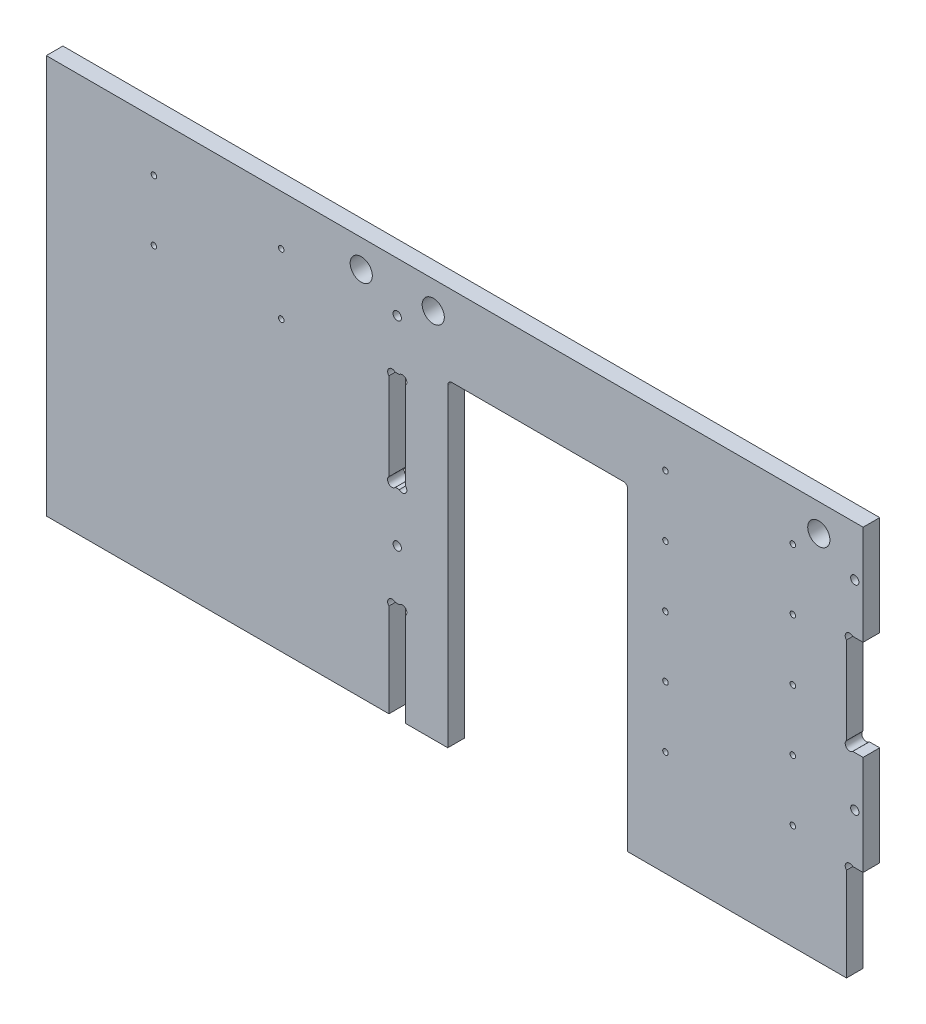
ISO-10303-21;
HEADER;
FILE_DESCRIPTION(('STEP AP214'),'2;1');
FILE_NAME('part.step','',(''),(''),'','','');
FILE_SCHEMA(('AUTOMOTIVE_DESIGN { 1 0 10303 214 1 1 1 1 }'));
ENDSEC;
DATA;
#1=APPLICATION_CONTEXT('core data for automotive mechanical design processes');
#2=APPLICATION_PROTOCOL_DEFINITION('international standard','automotive_design',2000,#1);
#3=PRODUCT_CONTEXT('',#1,'mechanical');
#4=PRODUCT('Part','Part','',(#3));
#5=PRODUCT_RELATED_PRODUCT_CATEGORY('part','',(#4));
#6=PRODUCT_DEFINITION_FORMATION('','',#4);
#7=PRODUCT_DEFINITION_CONTEXT('part definition',#1,'design');
#8=PRODUCT_DEFINITION('design','',#6,#7);
#9=PRODUCT_DEFINITION_SHAPE('','',#8);
#10=(LENGTH_UNIT() NAMED_UNIT(*) SI_UNIT(.MILLI.,.METRE.));
#11=(NAMED_UNIT(*) PLANE_ANGLE_UNIT() SI_UNIT($,.RADIAN.));
#12=(NAMED_UNIT(*) SI_UNIT($,.STERADIAN.) SOLID_ANGLE_UNIT());
#13=UNCERTAINTY_MEASURE_WITH_UNIT(LENGTH_MEASURE(1.E-05),#10,'distance_accuracy_value','');
#14=(GEOMETRIC_REPRESENTATION_CONTEXT(3) GLOBAL_UNCERTAINTY_ASSIGNED_CONTEXT((#13)) GLOBAL_UNIT_ASSIGNED_CONTEXT((#10,
#11,#12)) REPRESENTATION_CONTEXT('',''));
#15=CARTESIAN_POINT('',(0.,0.,0.));
#16=DIRECTION('',(0.,0.,1.));
#17=DIRECTION('',(1.,0.,0.));
#18=AXIS2_PLACEMENT_3D('',#15,#16,#17);
#19=CARTESIAN_POINT('',(0.,0.,6.));
#20=DIRECTION('',(0.,1.,0.));
#21=DIRECTION('',(-1.,0.,0.));
#22=AXIS2_PLACEMENT_3D('',#19,#20,#21);
#23=PLANE('',#22);
#24=DIRECTION('',(1.,0.,0.));
#25=VECTOR('',#24,1.);
#26=CARTESIAN_POINT('',(0.,0.,0.));
#27=LINE('',#26,#25);
#28=CARTESIAN_POINT('',(0.,0.,0.));
#29=VERTEX_POINT('',#28);
#30=CARTESIAN_POINT('',(123.75,0.,0.));
#31=VERTEX_POINT('',#30);
#32=EDGE_CURVE('E367',#29,#31,#27,.T.);
#33=ORIENTED_EDGE('',*,*,#32,.T.);
#34=DIRECTION('',(0.,0.,1.));
#35=VECTOR('',#34,1.);
#36=CARTESIAN_POINT('',(123.75,0.,0.));
#37=LINE('',#36,#35);
#38=CARTESIAN_POINT('',(123.75,0.,6.));
#39=VERTEX_POINT('',#38);
#40=EDGE_CURVE('E272',#31,#39,#37,.T.);
#41=ORIENTED_EDGE('',*,*,#40,.T.);
#42=DIRECTION('',(1.,0.,0.));
#43=VECTOR('',#42,1.);
#44=CARTESIAN_POINT('',(0.,0.,6.));
#45=LINE('',#44,#43);
#46=CARTESIAN_POINT('',(0.,0.,6.));
#47=VERTEX_POINT('',#46);
#48=EDGE_CURVE('E393',#47,#39,#45,.T.);
#49=ORIENTED_EDGE('',*,*,#48,.F.);
#50=DIRECTION('',(0.,0.,-1.));
#51=VECTOR('',#50,1.);
#52=CARTESIAN_POINT('',(0.,0.,6.));
#53=LINE('',#52,#51);
#54=EDGE_CURVE('E433',#47,#29,#53,.T.);
#55=ORIENTED_EDGE('',*,*,#54,.T.);
#56=EDGE_LOOP('',(#33,#41,#49,#55));
#57=FACE_BOUND('',#56,.T.);
#58=ADVANCED_FACE('F26',(#57),#23,.F.);
#59=CARTESIAN_POINT('',(129.75,0.,6.));
#60=VERTEX_POINT('',#59);
#61=CARTESIAN_POINT('',(145.,0.,6.));
#62=VERTEX_POINT('',#61);
#63=EDGE_CURVE('E397',#60,#62,#45,.T.);
#64=ORIENTED_EDGE('',*,*,#63,.F.);
#65=DIRECTION('',(0.,0.,1.));
#66=VECTOR('',#65,1.);
#67=CARTESIAN_POINT('',(129.75,0.,0.));
#68=LINE('',#67,#66);
#69=CARTESIAN_POINT('',(129.75,0.,0.));
#70=VERTEX_POINT('',#69);
#71=EDGE_CURVE('E273',#70,#60,#68,.T.);
#72=ORIENTED_EDGE('',*,*,#71,.F.);
#73=CARTESIAN_POINT('',(145.,0.,0.));
#74=VERTEX_POINT('',#73);
#75=EDGE_CURVE('E371',#70,#74,#27,.T.);
#76=ORIENTED_EDGE('',*,*,#75,.T.);
#77=DIRECTION('',(0.,0.,1.));
#78=VECTOR('',#77,1.);
#79=CARTESIAN_POINT('',(145.,0.,0.));
#80=LINE('',#79,#78);
#81=EDGE_CURVE('E325',#74,#62,#80,.T.);
#82=ORIENTED_EDGE('',*,*,#81,.T.);
#83=EDGE_LOOP('',(#64,#72,#76,#82));
#84=FACE_BOUND('',#83,.T.);
#85=ADVANCED_FACE('F565',(#84),#23,.F.);
#86=CARTESIAN_POINT('',(0.,144.,6.));
#87=DIRECTION('',(1.,0.,0.));
#88=DIRECTION('',(0.,0.,-1.));
#89=AXIS2_PLACEMENT_3D('',#86,#87,#88);
#90=PLANE('',#89);
#91=DIRECTION('',(0.,-1.,0.));
#92=VECTOR('',#91,1.);
#93=CARTESIAN_POINT('',(0.,144.,0.));
#94=LINE('',#93,#92);
#95=CARTESIAN_POINT('',(0.,144.,0.));
#96=VERTEX_POINT('',#95);
#97=EDGE_CURVE('E363',#96,#29,#94,.T.);
#98=ORIENTED_EDGE('',*,*,#97,.T.);
#99=ORIENTED_EDGE('',*,*,#54,.F.);
#100=DIRECTION('',(0.,-1.,0.));
#101=VECTOR('',#100,1.);
#102=CARTESIAN_POINT('',(0.,144.,6.));
#103=LINE('',#102,#101);
#104=CARTESIAN_POINT('',(0.,144.,6.));
#105=VERTEX_POINT('',#104);
#106=EDGE_CURVE('E389',#105,#47,#103,.T.);
#107=ORIENTED_EDGE('',*,*,#106,.F.);
#108=DIRECTION('',(0.,0.,-1.));
#109=VECTOR('',#108,1.);
#110=CARTESIAN_POINT('',(0.,144.,6.));
#111=LINE('',#110,#109);
#112=EDGE_CURVE('E415',#105,#96,#111,.T.);
#113=ORIENTED_EDGE('',*,*,#112,.T.);
#114=EDGE_LOOP('',(#98,#99,#107,#113));
#115=FACE_BOUND('',#114,.T.);
#116=ADVANCED_FACE('F28',(#115),#90,.F.);
#117=CARTESIAN_POINT('',(210.,0.,6.));
#118=VERTEX_POINT('',#117);
#119=CARTESIAN_POINT('',(289.,0.,6.));
#120=VERTEX_POINT('',#119);
#121=EDGE_CURVE('E392',#118,#120,#45,.T.);
#122=ORIENTED_EDGE('',*,*,#121,.F.);
#123=DIRECTION('',(0.,0.,1.));
#124=VECTOR('',#123,1.);
#125=CARTESIAN_POINT('',(210.,0.,0.));
#126=LINE('',#125,#124);
#127=CARTESIAN_POINT('',(210.,0.,0.));
#128=VERTEX_POINT('',#127);
#129=EDGE_CURVE('E335',#128,#118,#126,.T.);
#130=ORIENTED_EDGE('',*,*,#129,.F.);
#131=CARTESIAN_POINT('',(289.,0.,0.));
#132=VERTEX_POINT('',#131);
#133=EDGE_CURVE('E366',#128,#132,#27,.T.);
#134=ORIENTED_EDGE('',*,*,#133,.T.);
#135=DIRECTION('',(0.,0.,-1.));
#136=VECTOR('',#135,1.);
#137=CARTESIAN_POINT('',(289.,0.,6.));
#138=LINE('',#137,#136);
#139=EDGE_CURVE('E430',#120,#132,#138,.T.);
#140=ORIENTED_EDGE('',*,*,#139,.F.);
#141=EDGE_LOOP('',(#122,#130,#134,#140));
#142=FACE_BOUND('',#141,.T.);
#143=ADVANCED_FACE('F558',(#142),#23,.F.);
#144=CARTESIAN_POINT('',(289.,0.,6.));
#145=DIRECTION('',(-1.,0.,0.));
#146=DIRECTION('',(0.,0.,1.));
#147=AXIS2_PLACEMENT_3D('',#144,#145,#146);
#148=PLANE('',#147);
#149=DIRECTION('',(0.,1.,0.));
#150=VECTOR('',#149,1.);
#151=CARTESIAN_POINT('',(289.,0.,0.));
#152=LINE('',#151,#150);
#153=CARTESIAN_POINT('',(289.,33.7372583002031,0.));
#154=VERTEX_POINT('',#153);
#155=EDGE_CURVE('E370',#132,#154,#152,.T.);
#156=ORIENTED_EDGE('',*,*,#155,.T.);
#157=DIRECTION('',(0.,0.,1.));
#158=VECTOR('',#157,1.);
#159=CARTESIAN_POINT('',(289.,33.7372583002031,0.));
#160=LINE('',#159,#158);
#161=CARTESIAN_POINT('',(289.,33.7372583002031,6.));
#162=VERTEX_POINT('',#161);
#163=EDGE_CURVE('E343',#154,#162,#160,.T.);
#164=ORIENTED_EDGE('',*,*,#163,.T.);
#165=DIRECTION('',(0.,1.,0.));
#166=VECTOR('',#165,1.);
#167=CARTESIAN_POINT('',(289.,0.,6.));
#168=LINE('',#167,#166);
#169=EDGE_CURVE('E396',#120,#162,#168,.T.);
#170=ORIENTED_EDGE('',*,*,#169,.F.);
#171=ORIENTED_EDGE('',*,*,#139,.T.);
#172=EDGE_LOOP('',(#156,#164,#170,#171));
#173=FACE_BOUND('',#172,.T.);
#174=ADVANCED_FACE('F551',(#173),#148,.F.);
#175=CARTESIAN_POINT('',(289.,36.,6.));
#176=DIRECTION('',(0.,1.,0.));
#177=DIRECTION('',(0.,0.,1.));
#178=AXIS2_PLACEMENT_3D('',#175,#176,#177);
#179=PLANE('',#178);
#180=DIRECTION('',(1.,0.,0.));
#181=VECTOR('',#180,1.);
#182=CARTESIAN_POINT('',(289.,36.,6.));
#183=LINE('',#182,#181);
#184=CARTESIAN_POINT('',(291.262741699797,36.,6.));
#185=VERTEX_POINT('',#184);
#186=CARTESIAN_POINT('',(295.,36.,6.));
#187=VERTEX_POINT('',#186);
#188=EDGE_CURVE('E400',#185,#187,#183,.T.);
#189=ORIENTED_EDGE('',*,*,#188,.F.);
#190=DIRECTION('',(0.,0.,1.));
#191=VECTOR('',#190,1.);
#192=CARTESIAN_POINT('',(291.262741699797,36.,0.));
#193=LINE('',#192,#191);
#194=CARTESIAN_POINT('',(291.262741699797,36.,0.));
#195=VERTEX_POINT('',#194);
#196=EDGE_CURVE('E340',#185,#195,#193,.F.);
#197=ORIENTED_EDGE('',*,*,#196,.T.);
#198=DIRECTION('',(1.,0.,0.));
#199=VECTOR('',#198,1.);
#200=CARTESIAN_POINT('',(289.,36.,0.));
#201=LINE('',#200,#199);
#202=CARTESIAN_POINT('',(295.,36.,0.));
#203=VERTEX_POINT('',#202);
#204=EDGE_CURVE('E374',#195,#203,#201,.T.);
#205=ORIENTED_EDGE('',*,*,#204,.T.);
#206=DIRECTION('',(0.,0.,-1.));
#207=VECTOR('',#206,1.);
#208=CARTESIAN_POINT('',(295.,36.,6.));
#209=LINE('',#208,#207);
#210=EDGE_CURVE('E427',#187,#203,#209,.T.);
#211=ORIENTED_EDGE('',*,*,#210,.F.);
#212=EDGE_LOOP('',(#189,#197,#205,#211));
#213=FACE_BOUND('',#212,.T.);
#214=ADVANCED_FACE('F545',(#213),#179,.F.);
#215=CARTESIAN_POINT('',(295.,36.,6.));
#216=DIRECTION('',(-1.,0.,0.));
#217=DIRECTION('',(0.,0.,1.));
#218=AXIS2_PLACEMENT_3D('',#215,#216,#217);
#219=PLANE('',#218);
#220=DIRECTION('',(0.,1.,0.));
#221=VECTOR('',#220,1.);
#222=CARTESIAN_POINT('',(295.,36.,0.));
#223=LINE('',#222,#221);
#224=CARTESIAN_POINT('',(295.,72.0000000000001,0.));
#225=VERTEX_POINT('',#224);
#226=EDGE_CURVE('E376',#203,#225,#223,.T.);
#227=ORIENTED_EDGE('',*,*,#226,.T.);
#228=DIRECTION('',(0.,0.,-1.));
#229=VECTOR('',#228,1.);
#230=CARTESIAN_POINT('',(295.,72.0000000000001,6.));
#231=LINE('',#230,#229);
#232=CARTESIAN_POINT('',(295.,72.0000000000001,6.));
#233=VERTEX_POINT('',#232);
#234=EDGE_CURVE('E424',#233,#225,#231,.T.);
#235=ORIENTED_EDGE('',*,*,#234,.F.);
#236=DIRECTION('',(0.,1.,0.));
#237=VECTOR('',#236,1.);
#238=CARTESIAN_POINT('',(295.,36.,6.));
#239=LINE('',#238,#237);
#240=EDGE_CURVE('E402',#187,#233,#239,.T.);
#241=ORIENTED_EDGE('',*,*,#240,.F.);
#242=ORIENTED_EDGE('',*,*,#210,.T.);
#243=EDGE_LOOP('',(#227,#235,#241,#242));
#244=FACE_BOUND('',#243,.T.);
#245=ADVANCED_FACE('F539',(#244),#219,.F.);
#246=CARTESIAN_POINT('',(295.,72.0000000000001,6.));
#247=DIRECTION('',(0.,-1.,0.));
#248=DIRECTION('',(0.,0.,-1.));
#249=AXIS2_PLACEMENT_3D('',#246,#247,#248);
#250=PLANE('',#249);
#251=DIRECTION('',(-1.,0.,0.));
#252=VECTOR('',#251,1.);
#253=CARTESIAN_POINT('',(295.,72.0000000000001,0.));
#254=LINE('',#253,#252);
#255=CARTESIAN_POINT('',(291.262741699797,72.0000000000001,0.));
#256=VERTEX_POINT('',#255);
#257=EDGE_CURVE('E378',#225,#256,#254,.T.);
#258=ORIENTED_EDGE('',*,*,#257,.T.);
#259=DIRECTION('',(0.,0.,1.));
#260=VECTOR('',#259,1.);
#261=CARTESIAN_POINT('',(291.262741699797,72.0000000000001,0.));
#262=LINE('',#261,#260);
#263=CARTESIAN_POINT('',(291.262741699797,72.0000000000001,6.));
#264=VERTEX_POINT('',#263);
#265=EDGE_CURVE('E351',#256,#264,#262,.T.);
#266=ORIENTED_EDGE('',*,*,#265,.T.);
#267=DIRECTION('',(-1.,0.,0.));
#268=VECTOR('',#267,1.);
#269=CARTESIAN_POINT('',(295.,72.0000000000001,6.));
#270=LINE('',#269,#268);
#271=EDGE_CURVE('E404',#233,#264,#270,.T.);
#272=ORIENTED_EDGE('',*,*,#271,.F.);
#273=ORIENTED_EDGE('',*,*,#234,.T.);
#274=EDGE_LOOP('',(#258,#266,#272,#273));
#275=FACE_BOUND('',#274,.T.);
#276=ADVANCED_FACE('F534',(#275),#250,.F.);
#277=CARTESIAN_POINT('',(289.,72.0000000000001,6.));
#278=DIRECTION('',(-1.,0.,0.));
#279=DIRECTION('',(0.,0.,1.));
#280=AXIS2_PLACEMENT_3D('',#277,#278,#279);
#281=PLANE('',#280);
#282=DIRECTION('',(0.,1.,0.));
#283=VECTOR('',#282,1.);
#284=CARTESIAN_POINT('',(289.,72.0000000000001,6.));
#285=LINE('',#284,#283);
#286=CARTESIAN_POINT('',(289.,74.2627416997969,6.));
#287=VERTEX_POINT('',#286);
#288=CARTESIAN_POINT('',(289.,105.737258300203,6.));
#289=VERTEX_POINT('',#288);
#290=EDGE_CURVE('E407',#287,#289,#285,.T.);
#291=ORIENTED_EDGE('',*,*,#290,.F.);
#292=DIRECTION('',(0.,0.,1.));
#293=VECTOR('',#292,1.);
#294=CARTESIAN_POINT('',(289.,74.2627416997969,0.));
#295=LINE('',#294,#293);
#296=CARTESIAN_POINT('',(289.,74.2627416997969,0.));
#297=VERTEX_POINT('',#296);
#298=EDGE_CURVE('E348',#287,#297,#295,.F.);
#299=ORIENTED_EDGE('',*,*,#298,.T.);
#300=DIRECTION('',(0.,1.,0.));
#301=VECTOR('',#300,1.);
#302=CARTESIAN_POINT('',(289.,72.0000000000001,0.));
#303=LINE('',#302,#301);
#304=CARTESIAN_POINT('',(289.,105.737258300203,0.));
#305=VERTEX_POINT('',#304);
#306=EDGE_CURVE('E381',#297,#305,#303,.T.);
#307=ORIENTED_EDGE('',*,*,#306,.T.);
#308=DIRECTION('',(0.,0.,1.));
#309=VECTOR('',#308,1.);
#310=CARTESIAN_POINT('',(289.,105.737258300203,0.));
#311=LINE('',#310,#309);
#312=EDGE_CURVE('E360',#305,#289,#311,.T.);
#313=ORIENTED_EDGE('',*,*,#312,.T.);
#314=EDGE_LOOP('',(#291,#299,#307,#313));
#315=FACE_BOUND('',#314,.T.);
#316=ADVANCED_FACE('F527',(#315),#281,.F.);
#317=CARTESIAN_POINT('',(289.,108.,6.));
#318=DIRECTION('',(0.,1.,0.));
#319=DIRECTION('',(0.,0.,1.));
#320=AXIS2_PLACEMENT_3D('',#317,#318,#319);
#321=PLANE('',#320);
#322=DIRECTION('',(1.,0.,0.));
#323=VECTOR('',#322,1.);
#324=CARTESIAN_POINT('',(289.,108.,6.));
#325=LINE('',#324,#323);
#326=CARTESIAN_POINT('',(291.262741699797,108.,6.));
#327=VERTEX_POINT('',#326);
#328=CARTESIAN_POINT('',(295.,108.,6.));
#329=VERTEX_POINT('',#328);
#330=EDGE_CURVE('E409',#327,#329,#325,.T.);
#331=ORIENTED_EDGE('',*,*,#330,.F.);
#332=DIRECTION('',(0.,0.,1.));
#333=VECTOR('',#332,1.);
#334=CARTESIAN_POINT('',(291.262741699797,108.,0.));
#335=LINE('',#334,#333);
#336=CARTESIAN_POINT('',(291.262741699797,108.,0.));
#337=VERTEX_POINT('',#336);
#338=EDGE_CURVE('E357',#327,#337,#335,.F.);
#339=ORIENTED_EDGE('',*,*,#338,.T.);
#340=DIRECTION('',(1.,0.,0.));
#341=VECTOR('',#340,1.);
#342=CARTESIAN_POINT('',(289.,108.,0.));
#343=LINE('',#342,#341);
#344=CARTESIAN_POINT('',(295.,108.,0.));
#345=VERTEX_POINT('',#344);
#346=EDGE_CURVE('E383',#337,#345,#343,.T.);
#347=ORIENTED_EDGE('',*,*,#346,.T.);
#348=DIRECTION('',(0.,0.,-1.));
#349=VECTOR('',#348,1.);
#350=CARTESIAN_POINT('',(295.,108.,6.));
#351=LINE('',#350,#349);
#352=EDGE_CURVE('E421',#329,#345,#351,.T.);
#353=ORIENTED_EDGE('',*,*,#352,.F.);
#354=EDGE_LOOP('',(#331,#339,#347,#353));
#355=FACE_BOUND('',#354,.T.);
#356=ADVANCED_FACE('F519',(#355),#321,.F.);
#357=CARTESIAN_POINT('',(295.,108.,6.));
#358=DIRECTION('',(-1.,0.,0.));
#359=DIRECTION('',(0.,0.,1.));
#360=AXIS2_PLACEMENT_3D('',#357,#358,#359);
#361=PLANE('',#360);
#362=DIRECTION('',(0.,1.,0.));
#363=VECTOR('',#362,1.);
#364=CARTESIAN_POINT('',(295.,108.,0.));
#365=LINE('',#364,#363);
#366=CARTESIAN_POINT('',(295.,144.,0.));
#367=VERTEX_POINT('',#366);
#368=EDGE_CURVE('E385',#345,#367,#365,.T.);
#369=ORIENTED_EDGE('',*,*,#368,.T.);
#370=DIRECTION('',(0.,0.,-1.));
#371=VECTOR('',#370,1.);
#372=CARTESIAN_POINT('',(295.,144.,6.));
#373=LINE('',#372,#371);
#374=CARTESIAN_POINT('',(295.,144.,6.));
#375=VERTEX_POINT('',#374);
#376=EDGE_CURVE('E418',#375,#367,#373,.T.);
#377=ORIENTED_EDGE('',*,*,#376,.F.);
#378=DIRECTION('',(0.,1.,0.));
#379=VECTOR('',#378,1.);
#380=CARTESIAN_POINT('',(295.,108.,6.));
#381=LINE('',#380,#379);
#382=EDGE_CURVE('E411',#329,#375,#381,.T.);
#383=ORIENTED_EDGE('',*,*,#382,.F.);
#384=ORIENTED_EDGE('',*,*,#352,.T.);
#385=EDGE_LOOP('',(#369,#377,#383,#384));
#386=FACE_BOUND('',#385,.T.);
#387=ADVANCED_FACE('F515',(#386),#361,.F.);
#388=CARTESIAN_POINT('',(295.,144.,6.));
#389=DIRECTION('',(0.,-1.,0.));
#390=DIRECTION('',(1.,0.,0.));
#391=AXIS2_PLACEMENT_3D('',#388,#389,#390);
#392=PLANE('',#391);
#393=DIRECTION('',(-1.,0.,0.));
#394=VECTOR('',#393,1.);
#395=CARTESIAN_POINT('',(295.,144.,0.));
#396=LINE('',#395,#394);
#397=EDGE_CURVE('E387',#367,#96,#396,.T.);
#398=ORIENTED_EDGE('',*,*,#397,.T.);
#399=ORIENTED_EDGE('',*,*,#112,.F.);
#400=DIRECTION('',(-1.,0.,0.));
#401=VECTOR('',#400,1.);
#402=CARTESIAN_POINT('',(295.,144.,6.));
#403=LINE('',#402,#401);
#404=EDGE_CURVE('E413',#375,#105,#403,.T.);
#405=ORIENTED_EDGE('',*,*,#404,.F.);
#406=ORIENTED_EDGE('',*,*,#376,.T.);
#407=EDGE_LOOP('',(#398,#399,#405,#406));
#408=FACE_BOUND('',#407,.T.);
#409=ADVANCED_FACE('F511',(#408),#392,.F.);
#410=CARTESIAN_POINT('',(0.,36.,6.));
#411=DIRECTION('',(0.,0.,1.));
#412=DIRECTION('',(1.,0.,0.));
#413=AXIS2_PLACEMENT_3D('',#410,#411,#412);
#414=PLANE('',#413);
#415=CARTESIAN_POINT('',(126.75,126.,6.));
#416=DIRECTION('',(0.,0.,1.));
#417=DIRECTION('',(1.,0.,0.));
#418=AXIS2_PLACEMENT_3D('',#415,#416,#417);
#419=CIRCLE('',#418,1.5);
#420=CARTESIAN_POINT('',(128.25,126.,6.));
#421=VERTEX_POINT('',#420);
#422=EDGE_CURVE('E702',#421,#421,#419,.T.);
#423=ORIENTED_EDGE('',*,*,#422,.F.);
#424=EDGE_LOOP('',(#423));
#425=FACE_BOUND('',#424,.T.);
#426=CARTESIAN_POINT('',(126.75,54.,6.));
#427=DIRECTION('',(0.,0.,1.));
#428=DIRECTION('',(1.,0.,0.));
#429=AXIS2_PLACEMENT_3D('',#426,#427,#428);
#430=CIRCLE('',#429,1.5);
#431=CARTESIAN_POINT('',(128.25,54.,6.));
#432=VERTEX_POINT('',#431);
#433=EDGE_CURVE('E696',#432,#432,#430,.T.);
#434=ORIENTED_EDGE('',*,*,#433,.F.);
#435=EDGE_LOOP('',(#434));
#436=FACE_BOUND('',#435,.T.);
#437=CARTESIAN_POINT('',(292.,54.0000000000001,6.));
#438=DIRECTION('',(0.,0.,1.));
#439=DIRECTION('',(1.,0.,0.));
#440=AXIS2_PLACEMENT_3D('',#437,#438,#439);
#441=CIRCLE('',#440,1.50000000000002);
#442=CARTESIAN_POINT('',(293.5,54.0000000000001,6.));
#443=VERTEX_POINT('',#442);
#444=EDGE_CURVE('E690',#443,#443,#441,.T.);
#445=ORIENTED_EDGE('',*,*,#444,.F.);
#446=EDGE_LOOP('',(#445));
#447=FACE_BOUND('',#446,.T.);
#448=CARTESIAN_POINT('',(292.,126.,6.));
#449=DIRECTION('',(0.,0.,1.));
#450=DIRECTION('',(1.,0.,0.));
#451=AXIS2_PLACEMENT_3D('',#448,#449,#450);
#452=CIRCLE('',#451,1.50000000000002);
#453=CARTESIAN_POINT('',(293.5,126.,6.));
#454=VERTEX_POINT('',#453);
#455=EDGE_CURVE('E684',#454,#454,#452,.T.);
#456=ORIENTED_EDGE('',*,*,#455,.F.);
#457=EDGE_LOOP('',(#456));
#458=FACE_BOUND('',#457,.T.);
#459=CARTESIAN_POINT('',(38.875,104.,6.));
#460=DIRECTION('',(0.,0.,1.));
#461=DIRECTION('',(1.,0.,0.));
#462=AXIS2_PLACEMENT_3D('',#459,#460,#461);
#463=CIRCLE('',#462,0.999999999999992);
#464=CARTESIAN_POINT('',(39.875,104.,6.));
#465=VERTEX_POINT('',#464);
#466=EDGE_CURVE('E678',#465,#465,#463,.T.);
#467=ORIENTED_EDGE('',*,*,#466,.F.);
#468=EDGE_LOOP('',(#467));
#469=FACE_BOUND('',#468,.T.);
#470=CARTESIAN_POINT('',(38.875,126.,6.));
#471=DIRECTION('',(0.,0.,1.));
#472=DIRECTION('',(1.,0.,0.));
#473=AXIS2_PLACEMENT_3D('',#470,#471,#472);
#474=CIRCLE('',#473,0.999999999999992);
#475=CARTESIAN_POINT('',(39.875,126.,6.));
#476=VERTEX_POINT('',#475);
#477=EDGE_CURVE('E672',#476,#476,#474,.T.);
#478=ORIENTED_EDGE('',*,*,#477,.F.);
#479=EDGE_LOOP('',(#478));
#480=FACE_BOUND('',#479,.T.);
#481=CARTESIAN_POINT('',(84.875,104.,6.));
#482=DIRECTION('',(0.,0.,1.));
#483=DIRECTION('',(1.,0.,0.));
#484=AXIS2_PLACEMENT_3D('',#481,#482,#483);
#485=CIRCLE('',#484,0.999999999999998);
#486=CARTESIAN_POINT('',(85.875,104.,6.));
#487=VERTEX_POINT('',#486);
#488=EDGE_CURVE('E666',#487,#487,#485,.T.);
#489=ORIENTED_EDGE('',*,*,#488,.F.);
#490=EDGE_LOOP('',(#489));
#491=FACE_BOUND('',#490,.T.);
#492=CARTESIAN_POINT('',(84.875,126.,6.));
#493=DIRECTION('',(0.,0.,1.));
#494=DIRECTION('',(1.,0.,0.));
#495=AXIS2_PLACEMENT_3D('',#492,#493,#494);
#496=CIRCLE('',#495,0.999999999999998);
#497=CARTESIAN_POINT('',(85.875,126.,6.));
#498=VERTEX_POINT('',#497);
#499=EDGE_CURVE('E660',#498,#498,#496,.T.);
#500=ORIENTED_EDGE('',*,*,#499,.F.);
#501=EDGE_LOOP('',(#500));
#502=FACE_BOUND('',#501,.T.);
#503=CARTESIAN_POINT('',(223.620911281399,104.,6.));
#504=DIRECTION('',(0.,0.,1.));
#505=DIRECTION('',(1.,0.,0.));
#506=AXIS2_PLACEMENT_3D('',#503,#504,#505);
#507=CIRCLE('',#506,0.999999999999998);
#508=CARTESIAN_POINT('',(224.620911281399,104.,6.));
#509=VERTEX_POINT('',#508);
#510=EDGE_CURVE('E654',#509,#509,#507,.T.);
#511=ORIENTED_EDGE('',*,*,#510,.F.);
#512=EDGE_LOOP('',(#511));
#513=FACE_BOUND('',#512,.T.);
#514=CARTESIAN_POINT('',(223.620911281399,82.0000000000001,6.));
#515=DIRECTION('',(0.,0.,1.));
#516=DIRECTION('',(1.,0.,0.));
#517=AXIS2_PLACEMENT_3D('',#514,#515,#516);
#518=CIRCLE('',#517,0.999999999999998);
#519=CARTESIAN_POINT('',(224.620911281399,82.0000000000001,6.));
#520=VERTEX_POINT('',#519);
#521=EDGE_CURVE('E648',#520,#520,#518,.T.);
#522=ORIENTED_EDGE('',*,*,#521,.F.);
#523=EDGE_LOOP('',(#522));
#524=FACE_BOUND('',#523,.T.);
#525=CARTESIAN_POINT('',(223.620911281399,60.0000000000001,6.));
#526=DIRECTION('',(0.,0.,1.));
#527=DIRECTION('',(1.,0.,0.));
#528=AXIS2_PLACEMENT_3D('',#525,#526,#527);
#529=CIRCLE('',#528,0.999999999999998);
#530=CARTESIAN_POINT('',(224.620911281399,60.0000000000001,6.));
#531=VERTEX_POINT('',#530);
#532=EDGE_CURVE('E642',#531,#531,#529,.T.);
#533=ORIENTED_EDGE('',*,*,#532,.F.);
#534=EDGE_LOOP('',(#533));
#535=FACE_BOUND('',#534,.T.);
#536=CARTESIAN_POINT('',(223.620911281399,38.0000000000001,6.));
#537=DIRECTION('',(0.,0.,1.));
#538=DIRECTION('',(1.,0.,0.));
#539=AXIS2_PLACEMENT_3D('',#536,#537,#538);
#540=CIRCLE('',#539,0.999999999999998);
#541=CARTESIAN_POINT('',(224.620911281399,38.0000000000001,6.));
#542=VERTEX_POINT('',#541);
#543=EDGE_CURVE('E636',#542,#542,#540,.T.);
#544=ORIENTED_EDGE('',*,*,#543,.F.);
#545=EDGE_LOOP('',(#544));
#546=FACE_BOUND('',#545,.T.);
#547=CARTESIAN_POINT('',(269.620911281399,38.0000000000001,6.));
#548=DIRECTION('',(0.,0.,1.));
#549=DIRECTION('',(1.,0.,0.));
#550=AXIS2_PLACEMENT_3D('',#547,#548,#549);
#551=CIRCLE('',#550,0.999999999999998);
#552=CARTESIAN_POINT('',(270.620911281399,38.0000000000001,6.));
#553=VERTEX_POINT('',#552);
#554=EDGE_CURVE('E630',#553,#553,#551,.T.);
#555=ORIENTED_EDGE('',*,*,#554,.F.);
#556=EDGE_LOOP('',(#555));
#557=FACE_BOUND('',#556,.T.);
#558=CARTESIAN_POINT('',(269.620911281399,60.0000000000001,6.));
#559=DIRECTION('',(0.,0.,1.));
#560=DIRECTION('',(1.,0.,0.));
#561=AXIS2_PLACEMENT_3D('',#558,#559,#560);
#562=CIRCLE('',#561,0.999999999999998);
#563=CARTESIAN_POINT('',(270.620911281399,60.0000000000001,6.));
#564=VERTEX_POINT('',#563);
#565=EDGE_CURVE('E624',#564,#564,#562,.T.);
#566=ORIENTED_EDGE('',*,*,#565,.F.);
#567=EDGE_LOOP('',(#566));
#568=FACE_BOUND('',#567,.T.);
#569=CARTESIAN_POINT('',(269.620911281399,82.0000000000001,6.));
#570=DIRECTION('',(0.,0.,1.));
#571=DIRECTION('',(1.,0.,0.));
#572=AXIS2_PLACEMENT_3D('',#569,#570,#571);
#573=CIRCLE('',#572,0.999999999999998);
#574=CARTESIAN_POINT('',(270.620911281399,82.0000000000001,6.));
#575=VERTEX_POINT('',#574);
#576=EDGE_CURVE('E618',#575,#575,#573,.T.);
#577=ORIENTED_EDGE('',*,*,#576,.F.);
#578=EDGE_LOOP('',(#577));
#579=FACE_BOUND('',#578,.T.);
#580=CARTESIAN_POINT('',(269.620911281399,104.,6.));
#581=DIRECTION('',(0.,0.,1.));
#582=DIRECTION('',(1.,0.,0.));
#583=AXIS2_PLACEMENT_3D('',#580,#581,#582);
#584=CIRCLE('',#583,0.999999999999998);
#585=CARTESIAN_POINT('',(270.620911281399,104.,6.));
#586=VERTEX_POINT('',#585);
#587=EDGE_CURVE('E612',#586,#586,#584,.T.);
#588=ORIENTED_EDGE('',*,*,#587,.F.);
#589=EDGE_LOOP('',(#588));
#590=FACE_BOUND('',#589,.T.);
#591=CARTESIAN_POINT('',(269.620911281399,126.,6.));
#592=DIRECTION('',(0.,0.,1.));
#593=DIRECTION('',(1.,0.,0.));
#594=AXIS2_PLACEMENT_3D('',#591,#592,#593);
#595=CIRCLE('',#594,0.999999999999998);
#596=CARTESIAN_POINT('',(270.620911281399,126.,6.));
#597=VERTEX_POINT('',#596);
#598=EDGE_CURVE('E606',#597,#597,#595,.T.);
#599=ORIENTED_EDGE('',*,*,#598,.F.);
#600=EDGE_LOOP('',(#599));
#601=FACE_BOUND('',#600,.T.);
#602=CARTESIAN_POINT('',(223.620911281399,126.,6.));
#603=DIRECTION('',(0.,0.,1.));
#604=DIRECTION('',(1.,0.,0.));
#605=AXIS2_PLACEMENT_3D('',#602,#603,#604);
#606=CIRCLE('',#605,0.999999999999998);
#607=CARTESIAN_POINT('',(224.620911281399,126.,6.));
#608=VERTEX_POINT('',#607);
#609=EDGE_CURVE('E600',#608,#608,#606,.T.);
#610=ORIENTED_EDGE('',*,*,#609,.F.);
#611=EDGE_LOOP('',(#610));
#612=FACE_BOUND('',#611,.T.);
#613=CARTESIAN_POINT('',(113.75,134.,6.));
#614=DIRECTION('',(0.,0.,1.));
#615=DIRECTION('',(1.,0.,0.));
#616=AXIS2_PLACEMENT_3D('',#613,#614,#615);
#617=CIRCLE('',#616,4.00000000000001);
#618=CARTESIAN_POINT('',(117.75,134.,6.));
#619=VERTEX_POINT('',#618);
#620=EDGE_CURVE('E594',#619,#619,#617,.T.);
#621=ORIENTED_EDGE('',*,*,#620,.F.);
#622=EDGE_LOOP('',(#621));
#623=FACE_BOUND('',#622,.T.);
#624=CARTESIAN_POINT('',(139.75,134.,6.));
#625=DIRECTION('',(0.,0.,1.));
#626=DIRECTION('',(1.,0.,0.));
#627=AXIS2_PLACEMENT_3D('',#624,#625,#626);
#628=CIRCLE('',#627,3.99999999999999);
#629=CARTESIAN_POINT('',(143.75,134.,6.));
#630=VERTEX_POINT('',#629);
#631=EDGE_CURVE('E588',#630,#630,#628,.T.);
#632=ORIENTED_EDGE('',*,*,#631,.F.);
#633=EDGE_LOOP('',(#632));
#634=FACE_BOUND('',#633,.T.);
#635=CARTESIAN_POINT('',(279.,134.,6.));
#636=DIRECTION('',(0.,0.,1.));
#637=DIRECTION('',(1.,0.,0.));
#638=AXIS2_PLACEMENT_3D('',#635,#636,#637);
#639=CIRCLE('',#638,3.99999999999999);
#640=CARTESIAN_POINT('',(283.,134.,6.));
#641=VERTEX_POINT('',#640);
#642=EDGE_CURVE('E582',#641,#641,#639,.T.);
#643=ORIENTED_EDGE('',*,*,#642,.F.);
#644=EDGE_LOOP('',(#643));
#645=FACE_BOUND('',#644,.T.);
#646=CARTESIAN_POINT('',(128.618629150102,34.8686291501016,6.));
#647=DIRECTION('',(0.,0.,1.));
#648=DIRECTION('',(1.,0.,0.));
#649=AXIS2_PLACEMENT_3D('',#646,#647,#648);
#650=CIRCLE('',#649,1.59999999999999);
#651=CARTESIAN_POINT('',(129.75,33.7372583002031,6.));
#652=VERTEX_POINT('',#651);
#653=CARTESIAN_POINT('',(127.487258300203,36.,6.));
#654=VERTEX_POINT('',#653);
#655=EDGE_CURVE('E239',#652,#654,#650,.T.);
#656=ORIENTED_EDGE('',*,*,#655,.F.);
#657=DIRECTION('',(0.,1.,0.));
#658=VECTOR('',#657,1.);
#659=CARTESIAN_POINT('',(129.75,0.,6.));
#660=LINE('',#659,#658);
#661=EDGE_CURVE('E261',#60,#652,#660,.T.);
#662=ORIENTED_EDGE('',*,*,#661,.F.);
#663=ORIENTED_EDGE('',*,*,#63,.T.);
#664=DIRECTION('',(0.,-1.,0.));
#665=VECTOR('',#664,1.);
#666=CARTESIAN_POINT('',(145.,0.,6.));
#667=LINE('',#666,#665);
#668=CARTESIAN_POINT('',(145.,113.5,6.));
#669=VERTEX_POINT('',#668);
#670=EDGE_CURVE('E295',#669,#62,#667,.T.);
#671=ORIENTED_EDGE('',*,*,#670,.F.);
#672=CARTESIAN_POINT('',(146.5,113.5,6.));
#673=DIRECTION('',(0.,0.,1.));
#674=DIRECTION('',(1.,0.,0.));
#675=AXIS2_PLACEMENT_3D('',#672,#673,#674);
#676=CIRCLE('',#675,1.5);
#677=CARTESIAN_POINT('',(146.5,115.,6.));
#678=VERTEX_POINT('',#677);
#679=EDGE_CURVE('E307',#678,#669,#676,.T.);
#680=ORIENTED_EDGE('',*,*,#679,.F.);
#681=DIRECTION('',(-1.,0.,0.));
#682=VECTOR('',#681,1.);
#683=CARTESIAN_POINT('',(146.5,115.,6.));
#684=LINE('',#683,#682);
#685=CARTESIAN_POINT('',(208.5,115.,6.));
#686=VERTEX_POINT('',#685);
#687=EDGE_CURVE('E304',#686,#678,#684,.T.);
#688=ORIENTED_EDGE('',*,*,#687,.F.);
#689=CARTESIAN_POINT('',(208.5,113.5,6.));
#690=DIRECTION('',(0.,0.,1.));
#691=DIRECTION('',(1.,0.,0.));
#692=AXIS2_PLACEMENT_3D('',#689,#690,#691);
#693=CIRCLE('',#692,1.5);
#694=CARTESIAN_POINT('',(210.,113.5,6.));
#695=VERTEX_POINT('',#694);
#696=EDGE_CURVE('E301',#695,#686,#693,.T.);
#697=ORIENTED_EDGE('',*,*,#696,.F.);
#698=DIRECTION('',(0.,1.,0.));
#699=VECTOR('',#698,1.);
#700=CARTESIAN_POINT('',(210.,0.,6.));
#701=LINE('',#700,#699);
#702=EDGE_CURVE('E298',#118,#695,#701,.T.);
#703=ORIENTED_EDGE('',*,*,#702,.F.);
#704=ORIENTED_EDGE('',*,*,#121,.T.);
#705=ORIENTED_EDGE('',*,*,#169,.T.);
#706=CARTESIAN_POINT('',(290.131370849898,34.8686291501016,6.));
#707=DIRECTION('',(0.,0.,1.));
#708=DIRECTION('',(1.,0.,0.));
#709=AXIS2_PLACEMENT_3D('',#706,#707,#708);
#710=CIRCLE('',#709,1.59999999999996);
#711=EDGE_CURVE('E328',#185,#162,#710,.T.);
#712=ORIENTED_EDGE('',*,*,#711,.F.);
#713=ORIENTED_EDGE('',*,*,#188,.T.);
#714=ORIENTED_EDGE('',*,*,#240,.T.);
#715=ORIENTED_EDGE('',*,*,#271,.T.);
#716=CARTESIAN_POINT('',(290.131370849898,73.1313708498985,6.));
#717=DIRECTION('',(0.,0.,1.));
#718=DIRECTION('',(1.,0.,0.));
#719=AXIS2_PLACEMENT_3D('',#716,#717,#718);
#720=CIRCLE('',#719,1.59999999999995);
#721=EDGE_CURVE('E346',#287,#264,#720,.T.);
#722=ORIENTED_EDGE('',*,*,#721,.F.);
#723=ORIENTED_EDGE('',*,*,#290,.T.);
#724=CARTESIAN_POINT('',(290.131370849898,106.868629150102,6.));
#725=DIRECTION('',(0.,0.,1.));
#726=DIRECTION('',(1.,0.,0.));
#727=AXIS2_PLACEMENT_3D('',#724,#725,#726);
#728=CIRCLE('',#727,1.60000000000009);
#729=EDGE_CURVE('E354',#327,#289,#728,.T.);
#730=ORIENTED_EDGE('',*,*,#729,.F.);
#731=ORIENTED_EDGE('',*,*,#330,.T.);
#732=ORIENTED_EDGE('',*,*,#382,.T.);
#733=ORIENTED_EDGE('',*,*,#404,.T.);
#734=ORIENTED_EDGE('',*,*,#106,.T.);
#735=ORIENTED_EDGE('',*,*,#48,.T.);
#736=DIRECTION('',(0.,-1.,0.));
#737=VECTOR('',#736,1.);
#738=CARTESIAN_POINT('',(123.75,0.,6.));
#739=LINE('',#738,#737);
#740=CARTESIAN_POINT('',(123.75,33.7372583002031,6.));
#741=VERTEX_POINT('',#740);
#742=EDGE_CURVE('E265',#741,#39,#739,.T.);
#743=ORIENTED_EDGE('',*,*,#742,.F.);
#744=CARTESIAN_POINT('',(124.881370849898,34.8686291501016,6.));
#745=DIRECTION('',(0.,0.,1.));
#746=DIRECTION('',(1.,0.,0.));
#747=AXIS2_PLACEMENT_3D('',#744,#745,#746);
#748=CIRCLE('',#747,1.59999999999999);
#749=CARTESIAN_POINT('',(126.012741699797,36.,6.));
#750=VERTEX_POINT('',#749);
#751=EDGE_CURVE('E254',#750,#741,#748,.T.);
#752=ORIENTED_EDGE('',*,*,#751,.F.);
#753=DIRECTION('',(-1.,0.,0.));
#754=VECTOR('',#753,1.);
#755=CARTESIAN_POINT('',(123.75,36.,6.));
#756=LINE('',#755,#754);
#757=EDGE_CURVE('E252',#654,#750,#756,.T.);
#758=ORIENTED_EDGE('',*,*,#757,.F.);
#759=EDGE_LOOP('',(#656,#662,#663,#671,#680,#688,#697,#703,#704,#705,#712,#713,#714,#715,#722,
#723,#730,#731,#732,#733,#734,#735,#743,#752,#758));
#760=FACE_BOUND('',#759,.T.);
#761=CARTESIAN_POINT('',(124.854700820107,73.0142410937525,6.));
#762=DIRECTION('',(0.,0.,1.));
#763=DIRECTION('',(1.,0.,0.));
#764=AXIS2_PLACEMENT_3D('',#761,#762,#763);
#765=CIRCLE('',#764,1.60000000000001);
#766=CARTESIAN_POINT('',(123.75,74.1716675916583,6.));
#767=VERTEX_POINT('',#766);
#768=CARTESIAN_POINT('',(126.092163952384,72.,6.));
#769=VERTEX_POINT('',#768);
#770=EDGE_CURVE('E463',#767,#769,#765,.T.);
#771=ORIENTED_EDGE('',*,*,#770,.F.);
#772=DIRECTION('',(0.,-1.,0.));
#773=VECTOR('',#772,1.);
#774=CARTESIAN_POINT('',(123.75,108.,6.));
#775=LINE('',#774,#773);
#776=CARTESIAN_POINT('',(123.75,105.737258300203,6.));
#777=VERTEX_POINT('',#776);
#778=EDGE_CURVE('E281',#777,#767,#775,.T.);
#779=ORIENTED_EDGE('',*,*,#778,.F.);
#780=CARTESIAN_POINT('',(124.881370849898,106.868629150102,6.));
#781=DIRECTION('',(0.,0.,1.));
#782=DIRECTION('',(1.,0.,0.));
#783=AXIS2_PLACEMENT_3D('',#780,#781,#782);
#784=CIRCLE('',#783,1.59999999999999);
#785=CARTESIAN_POINT('',(126.012741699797,108.,6.));
#786=VERTEX_POINT('',#785);
#787=EDGE_CURVE('E489',#786,#777,#784,.T.);
#788=ORIENTED_EDGE('',*,*,#787,.F.);
#789=DIRECTION('',(-1.,0.,0.));
#790=VECTOR('',#789,1.);
#791=CARTESIAN_POINT('',(129.75,108.,6.));
#792=LINE('',#791,#790);
#793=CARTESIAN_POINT('',(127.487258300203,108.,6.));
#794=VERTEX_POINT('',#793);
#795=EDGE_CURVE('E279',#794,#786,#792,.T.);
#796=ORIENTED_EDGE('',*,*,#795,.F.);
#797=CARTESIAN_POINT('',(128.618629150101,106.868629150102,6.));
#798=DIRECTION('',(0.,0.,1.));
#799=DIRECTION('',(1.,0.,0.));
#800=AXIS2_PLACEMENT_3D('',#797,#798,#799);
#801=CIRCLE('',#800,1.60000000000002);
#802=CARTESIAN_POINT('',(129.75,105.737258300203,6.));
#803=VERTEX_POINT('',#802);
#804=EDGE_CURVE('E482',#803,#794,#801,.T.);
#805=ORIENTED_EDGE('',*,*,#804,.F.);
#806=DIRECTION('',(0.,1.,0.));
#807=VECTOR('',#806,1.);
#808=CARTESIAN_POINT('',(129.75,108.,6.));
#809=LINE('',#808,#807);
#810=CARTESIAN_POINT('',(129.75,74.2627416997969,6.));
#811=VERTEX_POINT('',#810);
#812=EDGE_CURVE('E275',#811,#803,#809,.T.);
#813=ORIENTED_EDGE('',*,*,#812,.F.);
#814=CARTESIAN_POINT('',(128.618629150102,73.1313708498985,6.));
#815=DIRECTION('',(0.,0.,1.));
#816=DIRECTION('',(1.,0.,0.));
#817=AXIS2_PLACEMENT_3D('',#814,#815,#816);
#818=CIRCLE('',#817,1.59999999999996);
#819=CARTESIAN_POINT('',(127.487258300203,72.,6.));
#820=VERTEX_POINT('',#819);
#821=EDGE_CURVE('E474',#820,#811,#818,.T.);
#822=ORIENTED_EDGE('',*,*,#821,.F.);
#823=DIRECTION('',(1.,0.,0.));
#824=VECTOR('',#823,1.);
#825=CARTESIAN_POINT('',(129.75,72.,6.));
#826=LINE('',#825,#824);
#827=EDGE_CURVE('E284',#769,#820,#826,.T.);
#828=ORIENTED_EDGE('',*,*,#827,.F.);
#829=EDGE_LOOP('',(#771,#779,#788,#796,#805,#813,#822,#828));
#830=FACE_BOUND('',#829,.T.);
#831=ADVANCED_FACE('F256',(#425,#436,#447,#458,#469,#480,#491,#502,#513,#524,#535,#546,#557,
#568,#579,#590,#601,#612,#623,#634,#645,#760,#830),#414,.T.);
#832=CARTESIAN_POINT('',(0.,36.,0.));
#833=DIRECTION('',(0.,0.,1.));
#834=DIRECTION('',(1.,0.,0.));
#835=AXIS2_PLACEMENT_3D('',#832,#833,#834);
#836=PLANE('',#835);
#837=CARTESIAN_POINT('',(126.75,126.,0.));
#838=DIRECTION('',(0.,0.,1.));
#839=DIRECTION('',(1.,0.,0.));
#840=AXIS2_PLACEMENT_3D('',#837,#838,#839);
#841=CIRCLE('',#840,1.5);
#842=CARTESIAN_POINT('',(128.25,126.,0.));
#843=VERTEX_POINT('',#842);
#844=EDGE_CURVE('E699',#843,#843,#841,.T.);
#845=ORIENTED_EDGE('',*,*,#844,.T.);
#846=EDGE_LOOP('',(#845));
#847=FACE_BOUND('',#846,.T.);
#848=CARTESIAN_POINT('',(126.75,54.,0.));
#849=DIRECTION('',(0.,0.,1.));
#850=DIRECTION('',(1.,0.,0.));
#851=AXIS2_PLACEMENT_3D('',#848,#849,#850);
#852=CIRCLE('',#851,1.5);
#853=CARTESIAN_POINT('',(128.25,54.,0.));
#854=VERTEX_POINT('',#853);
#855=EDGE_CURVE('E693',#854,#854,#852,.T.);
#856=ORIENTED_EDGE('',*,*,#855,.T.);
#857=EDGE_LOOP('',(#856));
#858=FACE_BOUND('',#857,.T.);
#859=CARTESIAN_POINT('',(292.,54.0000000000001,0.));
#860=DIRECTION('',(0.,0.,1.));
#861=DIRECTION('',(1.,0.,0.));
#862=AXIS2_PLACEMENT_3D('',#859,#860,#861);
#863=CIRCLE('',#862,1.50000000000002);
#864=CARTESIAN_POINT('',(293.5,54.0000000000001,0.));
#865=VERTEX_POINT('',#864);
#866=EDGE_CURVE('E687',#865,#865,#863,.T.);
#867=ORIENTED_EDGE('',*,*,#866,.T.);
#868=EDGE_LOOP('',(#867));
#869=FACE_BOUND('',#868,.T.);
#870=CARTESIAN_POINT('',(292.,126.,0.));
#871=DIRECTION('',(0.,0.,1.));
#872=DIRECTION('',(1.,0.,0.));
#873=AXIS2_PLACEMENT_3D('',#870,#871,#872);
#874=CIRCLE('',#873,1.50000000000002);
#875=CARTESIAN_POINT('',(293.5,126.,0.));
#876=VERTEX_POINT('',#875);
#877=EDGE_CURVE('E681',#876,#876,#874,.T.);
#878=ORIENTED_EDGE('',*,*,#877,.T.);
#879=EDGE_LOOP('',(#878));
#880=FACE_BOUND('',#879,.T.);
#881=CARTESIAN_POINT('',(38.875,104.,0.));
#882=DIRECTION('',(0.,0.,1.));
#883=DIRECTION('',(1.,0.,0.));
#884=AXIS2_PLACEMENT_3D('',#881,#882,#883);
#885=CIRCLE('',#884,0.999999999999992);
#886=CARTESIAN_POINT('',(39.875,104.,0.));
#887=VERTEX_POINT('',#886);
#888=EDGE_CURVE('E675',#887,#887,#885,.T.);
#889=ORIENTED_EDGE('',*,*,#888,.T.);
#890=EDGE_LOOP('',(#889));
#891=FACE_BOUND('',#890,.T.);
#892=CARTESIAN_POINT('',(38.875,126.,0.));
#893=DIRECTION('',(0.,0.,1.));
#894=DIRECTION('',(1.,0.,0.));
#895=AXIS2_PLACEMENT_3D('',#892,#893,#894);
#896=CIRCLE('',#895,0.999999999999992);
#897=CARTESIAN_POINT('',(39.875,126.,0.));
#898=VERTEX_POINT('',#897);
#899=EDGE_CURVE('E669',#898,#898,#896,.T.);
#900=ORIENTED_EDGE('',*,*,#899,.T.);
#901=EDGE_LOOP('',(#900));
#902=FACE_BOUND('',#901,.T.);
#903=CARTESIAN_POINT('',(84.875,104.,0.));
#904=DIRECTION('',(0.,0.,1.));
#905=DIRECTION('',(1.,0.,0.));
#906=AXIS2_PLACEMENT_3D('',#903,#904,#905);
#907=CIRCLE('',#906,0.999999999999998);
#908=CARTESIAN_POINT('',(85.875,104.,0.));
#909=VERTEX_POINT('',#908);
#910=EDGE_CURVE('E663',#909,#909,#907,.T.);
#911=ORIENTED_EDGE('',*,*,#910,.T.);
#912=EDGE_LOOP('',(#911));
#913=FACE_BOUND('',#912,.T.);
#914=CARTESIAN_POINT('',(84.875,126.,0.));
#915=DIRECTION('',(0.,0.,1.));
#916=DIRECTION('',(1.,0.,0.));
#917=AXIS2_PLACEMENT_3D('',#914,#915,#916);
#918=CIRCLE('',#917,0.999999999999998);
#919=CARTESIAN_POINT('',(85.875,126.,0.));
#920=VERTEX_POINT('',#919);
#921=EDGE_CURVE('E657',#920,#920,#918,.T.);
#922=ORIENTED_EDGE('',*,*,#921,.T.);
#923=EDGE_LOOP('',(#922));
#924=FACE_BOUND('',#923,.T.);
#925=CARTESIAN_POINT('',(223.620911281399,104.,0.));
#926=DIRECTION('',(0.,0.,1.));
#927=DIRECTION('',(1.,0.,0.));
#928=AXIS2_PLACEMENT_3D('',#925,#926,#927);
#929=CIRCLE('',#928,0.999999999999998);
#930=CARTESIAN_POINT('',(224.620911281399,104.,0.));
#931=VERTEX_POINT('',#930);
#932=EDGE_CURVE('E651',#931,#931,#929,.T.);
#933=ORIENTED_EDGE('',*,*,#932,.T.);
#934=EDGE_LOOP('',(#933));
#935=FACE_BOUND('',#934,.T.);
#936=CARTESIAN_POINT('',(223.620911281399,82.0000000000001,0.));
#937=DIRECTION('',(0.,0.,1.));
#938=DIRECTION('',(1.,0.,0.));
#939=AXIS2_PLACEMENT_3D('',#936,#937,#938);
#940=CIRCLE('',#939,0.999999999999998);
#941=CARTESIAN_POINT('',(224.620911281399,82.0000000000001,0.));
#942=VERTEX_POINT('',#941);
#943=EDGE_CURVE('E645',#942,#942,#940,.T.);
#944=ORIENTED_EDGE('',*,*,#943,.T.);
#945=EDGE_LOOP('',(#944));
#946=FACE_BOUND('',#945,.T.);
#947=CARTESIAN_POINT('',(223.620911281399,60.0000000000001,0.));
#948=DIRECTION('',(0.,0.,1.));
#949=DIRECTION('',(1.,0.,0.));
#950=AXIS2_PLACEMENT_3D('',#947,#948,#949);
#951=CIRCLE('',#950,0.999999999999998);
#952=CARTESIAN_POINT('',(224.620911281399,60.0000000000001,0.));
#953=VERTEX_POINT('',#952);
#954=EDGE_CURVE('E639',#953,#953,#951,.T.);
#955=ORIENTED_EDGE('',*,*,#954,.T.);
#956=EDGE_LOOP('',(#955));
#957=FACE_BOUND('',#956,.T.);
#958=CARTESIAN_POINT('',(223.620911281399,38.0000000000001,0.));
#959=DIRECTION('',(0.,0.,1.));
#960=DIRECTION('',(1.,0.,0.));
#961=AXIS2_PLACEMENT_3D('',#958,#959,#960);
#962=CIRCLE('',#961,0.999999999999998);
#963=CARTESIAN_POINT('',(224.620911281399,38.0000000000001,0.));
#964=VERTEX_POINT('',#963);
#965=EDGE_CURVE('E633',#964,#964,#962,.T.);
#966=ORIENTED_EDGE('',*,*,#965,.T.);
#967=EDGE_LOOP('',(#966));
#968=FACE_BOUND('',#967,.T.);
#969=CARTESIAN_POINT('',(269.620911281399,38.0000000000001,0.));
#970=DIRECTION('',(0.,0.,1.));
#971=DIRECTION('',(1.,0.,0.));
#972=AXIS2_PLACEMENT_3D('',#969,#970,#971);
#973=CIRCLE('',#972,0.999999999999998);
#974=CARTESIAN_POINT('',(270.620911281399,38.0000000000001,0.));
#975=VERTEX_POINT('',#974);
#976=EDGE_CURVE('E627',#975,#975,#973,.T.);
#977=ORIENTED_EDGE('',*,*,#976,.T.);
#978=EDGE_LOOP('',(#977));
#979=FACE_BOUND('',#978,.T.);
#980=CARTESIAN_POINT('',(269.620911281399,60.0000000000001,0.));
#981=DIRECTION('',(0.,0.,1.));
#982=DIRECTION('',(1.,0.,0.));
#983=AXIS2_PLACEMENT_3D('',#980,#981,#982);
#984=CIRCLE('',#983,0.999999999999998);
#985=CARTESIAN_POINT('',(270.620911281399,60.0000000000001,0.));
#986=VERTEX_POINT('',#985);
#987=EDGE_CURVE('E621',#986,#986,#984,.T.);
#988=ORIENTED_EDGE('',*,*,#987,.T.);
#989=EDGE_LOOP('',(#988));
#990=FACE_BOUND('',#989,.T.);
#991=CARTESIAN_POINT('',(269.620911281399,82.0000000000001,0.));
#992=DIRECTION('',(0.,0.,1.));
#993=DIRECTION('',(1.,0.,0.));
#994=AXIS2_PLACEMENT_3D('',#991,#992,#993);
#995=CIRCLE('',#994,0.999999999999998);
#996=CARTESIAN_POINT('',(270.620911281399,82.0000000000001,0.));
#997=VERTEX_POINT('',#996);
#998=EDGE_CURVE('E615',#997,#997,#995,.T.);
#999=ORIENTED_EDGE('',*,*,#998,.T.);
#1000=EDGE_LOOP('',(#999));
#1001=FACE_BOUND('',#1000,.T.);
#1002=CARTESIAN_POINT('',(269.620911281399,104.,0.));
#1003=DIRECTION('',(0.,0.,1.));
#1004=DIRECTION('',(1.,0.,0.));
#1005=AXIS2_PLACEMENT_3D('',#1002,#1003,#1004);
#1006=CIRCLE('',#1005,0.999999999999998);
#1007=CARTESIAN_POINT('',(270.620911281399,104.,0.));
#1008=VERTEX_POINT('',#1007);
#1009=EDGE_CURVE('E609',#1008,#1008,#1006,.T.);
#1010=ORIENTED_EDGE('',*,*,#1009,.T.);
#1011=EDGE_LOOP('',(#1010));
#1012=FACE_BOUND('',#1011,.T.);
#1013=CARTESIAN_POINT('',(269.620911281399,126.,0.));
#1014=DIRECTION('',(0.,0.,1.));
#1015=DIRECTION('',(1.,0.,0.));
#1016=AXIS2_PLACEMENT_3D('',#1013,#1014,#1015);
#1017=CIRCLE('',#1016,0.999999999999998);
#1018=CARTESIAN_POINT('',(270.620911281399,126.,0.));
#1019=VERTEX_POINT('',#1018);
#1020=EDGE_CURVE('E603',#1019,#1019,#1017,.T.);
#1021=ORIENTED_EDGE('',*,*,#1020,.T.);
#1022=EDGE_LOOP('',(#1021));
#1023=FACE_BOUND('',#1022,.T.);
#1024=CARTESIAN_POINT('',(223.620911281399,126.,0.));
#1025=DIRECTION('',(0.,0.,1.));
#1026=DIRECTION('',(1.,0.,0.));
#1027=AXIS2_PLACEMENT_3D('',#1024,#1025,#1026);
#1028=CIRCLE('',#1027,0.999999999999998);
#1029=CARTESIAN_POINT('',(224.620911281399,126.,0.));
#1030=VERTEX_POINT('',#1029);
#1031=EDGE_CURVE('E597',#1030,#1030,#1028,.T.);
#1032=ORIENTED_EDGE('',*,*,#1031,.T.);
#1033=EDGE_LOOP('',(#1032));
#1034=FACE_BOUND('',#1033,.T.);
#1035=CARTESIAN_POINT('',(113.75,134.,0.));
#1036=DIRECTION('',(0.,0.,1.));
#1037=DIRECTION('',(1.,0.,0.));
#1038=AXIS2_PLACEMENT_3D('',#1035,#1036,#1037);
#1039=CIRCLE('',#1038,4.00000000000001);
#1040=CARTESIAN_POINT('',(117.75,134.,0.));
#1041=VERTEX_POINT('',#1040);
#1042=EDGE_CURVE('E591',#1041,#1041,#1039,.T.);
#1043=ORIENTED_EDGE('',*,*,#1042,.T.);
#1044=EDGE_LOOP('',(#1043));
#1045=FACE_BOUND('',#1044,.T.);
#1046=CARTESIAN_POINT('',(139.75,134.,0.));
#1047=DIRECTION('',(0.,0.,1.));
#1048=DIRECTION('',(1.,0.,0.));
#1049=AXIS2_PLACEMENT_3D('',#1046,#1047,#1048);
#1050=CIRCLE('',#1049,3.99999999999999);
#1051=CARTESIAN_POINT('',(143.75,134.,0.));
#1052=VERTEX_POINT('',#1051);
#1053=EDGE_CURVE('E585',#1052,#1052,#1050,.T.);
#1054=ORIENTED_EDGE('',*,*,#1053,.T.);
#1055=EDGE_LOOP('',(#1054));
#1056=FACE_BOUND('',#1055,.T.);
#1057=CARTESIAN_POINT('',(279.,134.,0.));
#1058=DIRECTION('',(0.,0.,1.));
#1059=DIRECTION('',(1.,0.,0.));
#1060=AXIS2_PLACEMENT_3D('',#1057,#1058,#1059);
#1061=CIRCLE('',#1060,3.99999999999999);
#1062=CARTESIAN_POINT('',(283.,134.,0.));
#1063=VERTEX_POINT('',#1062);
#1064=EDGE_CURVE('E247',#1063,#1063,#1061,.T.);
#1065=ORIENTED_EDGE('',*,*,#1064,.T.);
#1066=EDGE_LOOP('',(#1065));
#1067=FACE_BOUND('',#1066,.T.);
#1068=DIRECTION('',(0.,-1.,0.));
#1069=VECTOR('',#1068,1.);
#1070=CARTESIAN_POINT('',(123.75,108.,0.));
#1071=LINE('',#1070,#1069);
#1072=CARTESIAN_POINT('',(123.75,105.737258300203,0.));
#1073=VERTEX_POINT('',#1072);
#1074=CARTESIAN_POINT('',(123.75,74.1716675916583,0.));
#1075=VERTEX_POINT('',#1074);
#1076=EDGE_CURVE('E290',#1073,#1075,#1071,.T.);
#1077=ORIENTED_EDGE('',*,*,#1076,.T.);
#1078=CARTESIAN_POINT('',(124.854700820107,73.0142410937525,0.));
#1079=DIRECTION('',(0.,0.,1.));
#1080=DIRECTION('',(1.,0.,0.));
#1081=AXIS2_PLACEMENT_3D('',#1078,#1079,#1080);
#1082=CIRCLE('',#1081,1.60000000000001);
#1083=CARTESIAN_POINT('',(126.092163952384,72.,0.));
#1084=VERTEX_POINT('',#1083);
#1085=EDGE_CURVE('E468',#1075,#1084,#1082,.T.);
#1086=ORIENTED_EDGE('',*,*,#1085,.T.);
#1087=DIRECTION('',(1.,0.,0.));
#1088=VECTOR('',#1087,1.);
#1089=CARTESIAN_POINT('',(129.75,72.,0.));
#1090=LINE('',#1089,#1088);
#1091=CARTESIAN_POINT('',(127.487258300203,72.,0.));
#1092=VERTEX_POINT('',#1091);
#1093=EDGE_CURVE('E293',#1084,#1092,#1090,.T.);
#1094=ORIENTED_EDGE('',*,*,#1093,.T.);
#1095=CARTESIAN_POINT('',(128.618629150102,73.1313708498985,0.));
#1096=DIRECTION('',(0.,0.,1.));
#1097=DIRECTION('',(1.,0.,0.));
#1098=AXIS2_PLACEMENT_3D('',#1095,#1096,#1097);
#1099=CIRCLE('',#1098,1.59999999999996);
#1100=CARTESIAN_POINT('',(129.75,74.2627416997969,0.));
#1101=VERTEX_POINT('',#1100);
#1102=EDGE_CURVE('E476',#1092,#1101,#1099,.T.);
#1103=ORIENTED_EDGE('',*,*,#1102,.T.);
#1104=DIRECTION('',(0.,1.,0.));
#1105=VECTOR('',#1104,1.);
#1106=CARTESIAN_POINT('',(129.75,108.,0.));
#1107=LINE('',#1106,#1105);
#1108=CARTESIAN_POINT('',(129.75,105.737258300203,0.));
#1109=VERTEX_POINT('',#1108);
#1110=EDGE_CURVE('E286',#1101,#1109,#1107,.T.);
#1111=ORIENTED_EDGE('',*,*,#1110,.T.);
#1112=CARTESIAN_POINT('',(128.618629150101,106.868629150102,0.));
#1113=DIRECTION('',(0.,0.,1.));
#1114=DIRECTION('',(1.,0.,0.));
#1115=AXIS2_PLACEMENT_3D('',#1112,#1113,#1114);
#1116=CIRCLE('',#1115,1.60000000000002);
#1117=CARTESIAN_POINT('',(127.487258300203,108.,0.));
#1118=VERTEX_POINT('',#1117);
#1119=EDGE_CURVE('E484',#1109,#1118,#1116,.T.);
#1120=ORIENTED_EDGE('',*,*,#1119,.T.);
#1121=DIRECTION('',(-1.,0.,0.));
#1122=VECTOR('',#1121,1.);
#1123=CARTESIAN_POINT('',(129.75,108.,0.));
#1124=LINE('',#1123,#1122);
#1125=CARTESIAN_POINT('',(126.012741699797,108.,0.));
#1126=VERTEX_POINT('',#1125);
#1127=EDGE_CURVE('E288',#1118,#1126,#1124,.T.);
#1128=ORIENTED_EDGE('',*,*,#1127,.T.);
#1129=CARTESIAN_POINT('',(124.881370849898,106.868629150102,0.));
#1130=DIRECTION('',(0.,0.,1.));
#1131=DIRECTION('',(1.,0.,0.));
#1132=AXIS2_PLACEMENT_3D('',#1129,#1130,#1131);
#1133=CIRCLE('',#1132,1.59999999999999);
#1134=EDGE_CURVE('E491',#1126,#1073,#1133,.T.);
#1135=ORIENTED_EDGE('',*,*,#1134,.T.);
#1136=EDGE_LOOP('',(#1077,#1086,#1094,#1103,#1111,#1120,#1128,#1135));
#1137=FACE_BOUND('',#1136,.T.);
#1138=DIRECTION('',(0.,1.,0.));
#1139=VECTOR('',#1138,1.);
#1140=CARTESIAN_POINT('',(129.75,0.,0.));
#1141=LINE('',#1140,#1139);
#1142=CARTESIAN_POINT('',(129.75,33.7372583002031,0.));
#1143=VERTEX_POINT('',#1142);
#1144=EDGE_CURVE('E263',#70,#1143,#1141,.T.);
#1145=ORIENTED_EDGE('',*,*,#1144,.T.);
#1146=CARTESIAN_POINT('',(128.618629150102,34.8686291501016,0.));
#1147=DIRECTION('',(0.,0.,1.));
#1148=DIRECTION('',(1.,0.,0.));
#1149=AXIS2_PLACEMENT_3D('',#1146,#1147,#1148);
#1150=CIRCLE('',#1149,1.59999999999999);
#1151=CARTESIAN_POINT('',(127.487258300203,36.,0.));
#1152=VERTEX_POINT('',#1151);
#1153=EDGE_CURVE('E41',#1143,#1152,#1150,.T.);
#1154=ORIENTED_EDGE('',*,*,#1153,.T.);
#1155=DIRECTION('',(-1.,0.,0.));
#1156=VECTOR('',#1155,1.);
#1157=CARTESIAN_POINT('',(123.75,36.,0.));
#1158=LINE('',#1157,#1156);
#1159=CARTESIAN_POINT('',(126.012741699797,36.,0.));
#1160=VERTEX_POINT('',#1159);
#1161=EDGE_CURVE('E47',#1152,#1160,#1158,.T.);
#1162=ORIENTED_EDGE('',*,*,#1161,.T.);
#1163=CARTESIAN_POINT('',(124.881370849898,34.8686291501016,0.));
#1164=DIRECTION('',(0.,0.,1.));
#1165=DIRECTION('',(1.,0.,0.));
#1166=AXIS2_PLACEMENT_3D('',#1163,#1164,#1165);
#1167=CIRCLE('',#1166,1.59999999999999);
#1168=CARTESIAN_POINT('',(123.75,33.7372583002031,0.));
#1169=VERTEX_POINT('',#1168);
#1170=EDGE_CURVE('E459',#1160,#1169,#1167,.T.);
#1171=ORIENTED_EDGE('',*,*,#1170,.T.);
#1172=DIRECTION('',(0.,-1.,0.));
#1173=VECTOR('',#1172,1.);
#1174=CARTESIAN_POINT('',(123.75,0.,0.));
#1175=LINE('',#1174,#1173);
#1176=EDGE_CURVE('E260',#1169,#31,#1175,.T.);
#1177=ORIENTED_EDGE('',*,*,#1176,.T.);
#1178=ORIENTED_EDGE('',*,*,#32,.F.);
#1179=ORIENTED_EDGE('',*,*,#97,.F.);
#1180=ORIENTED_EDGE('',*,*,#397,.F.);
#1181=ORIENTED_EDGE('',*,*,#368,.F.);
#1182=ORIENTED_EDGE('',*,*,#346,.F.);
#1183=CARTESIAN_POINT('',(290.131370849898,106.868629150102,0.));
#1184=DIRECTION('',(0.,0.,1.));
#1185=DIRECTION('',(1.,0.,0.));
#1186=AXIS2_PLACEMENT_3D('',#1183,#1184,#1185);
#1187=CIRCLE('',#1186,1.60000000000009);
#1188=EDGE_CURVE('E436',#337,#305,#1187,.T.);
#1189=ORIENTED_EDGE('',*,*,#1188,.T.);
#1190=ORIENTED_EDGE('',*,*,#306,.F.);
#1191=CARTESIAN_POINT('',(290.131370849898,73.1313708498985,0.));
#1192=DIRECTION('',(0.,0.,1.));
#1193=DIRECTION('',(1.,0.,0.));
#1194=AXIS2_PLACEMENT_3D('',#1191,#1192,#1193);
#1195=CIRCLE('',#1194,1.59999999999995);
#1196=EDGE_CURVE('E439',#297,#256,#1195,.T.);
#1197=ORIENTED_EDGE('',*,*,#1196,.T.);
#1198=ORIENTED_EDGE('',*,*,#257,.F.);
#1199=ORIENTED_EDGE('',*,*,#226,.F.);
#1200=ORIENTED_EDGE('',*,*,#204,.F.);
#1201=CARTESIAN_POINT('',(290.131370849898,34.8686291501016,0.));
#1202=DIRECTION('',(0.,0.,1.));
#1203=DIRECTION('',(1.,0.,0.));
#1204=AXIS2_PLACEMENT_3D('',#1201,#1202,#1203);
#1205=CIRCLE('',#1204,1.59999999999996);
#1206=EDGE_CURVE('E442',#195,#154,#1205,.T.);
#1207=ORIENTED_EDGE('',*,*,#1206,.T.);
#1208=ORIENTED_EDGE('',*,*,#155,.F.);
#1209=ORIENTED_EDGE('',*,*,#133,.F.);
#1210=DIRECTION('',(0.,1.,0.));
#1211=VECTOR('',#1210,1.);
#1212=CARTESIAN_POINT('',(210.,0.,0.));
#1213=LINE('',#1212,#1211);
#1214=CARTESIAN_POINT('',(210.,113.5,0.));
#1215=VERTEX_POINT('',#1214);
#1216=EDGE_CURVE('E313',#128,#1215,#1213,.T.);
#1217=ORIENTED_EDGE('',*,*,#1216,.T.);
#1218=CARTESIAN_POINT('',(208.5,113.5,0.));
#1219=DIRECTION('',(0.,0.,1.));
#1220=DIRECTION('',(1.,0.,0.));
#1221=AXIS2_PLACEMENT_3D('',#1218,#1219,#1220);
#1222=CIRCLE('',#1221,1.5);
#1223=CARTESIAN_POINT('',(208.5,115.,0.));
#1224=VERTEX_POINT('',#1223);
#1225=EDGE_CURVE('E316',#1215,#1224,#1222,.T.);
#1226=ORIENTED_EDGE('',*,*,#1225,.T.);
#1227=DIRECTION('',(-1.,0.,0.));
#1228=VECTOR('',#1227,1.);
#1229=CARTESIAN_POINT('',(146.5,115.,0.));
#1230=LINE('',#1229,#1228);
#1231=CARTESIAN_POINT('',(146.5,115.,0.));
#1232=VERTEX_POINT('',#1231);
#1233=EDGE_CURVE('E319',#1224,#1232,#1230,.T.);
#1234=ORIENTED_EDGE('',*,*,#1233,.T.);
#1235=CARTESIAN_POINT('',(146.5,113.5,0.));
#1236=DIRECTION('',(0.,0.,1.));
#1237=DIRECTION('',(1.,0.,0.));
#1238=AXIS2_PLACEMENT_3D('',#1235,#1236,#1237);
#1239=CIRCLE('',#1238,1.5);
#1240=CARTESIAN_POINT('',(145.,113.5,0.));
#1241=VERTEX_POINT('',#1240);
#1242=EDGE_CURVE('E322',#1232,#1241,#1239,.T.);
#1243=ORIENTED_EDGE('',*,*,#1242,.T.);
#1244=DIRECTION('',(0.,-1.,0.));
#1245=VECTOR('',#1244,1.);
#1246=CARTESIAN_POINT('',(145.,0.,0.));
#1247=LINE('',#1246,#1245);
#1248=EDGE_CURVE('E310',#1241,#74,#1247,.T.);
#1249=ORIENTED_EDGE('',*,*,#1248,.T.);
#1250=ORIENTED_EDGE('',*,*,#75,.F.);
#1251=EDGE_LOOP('',(#1145,#1154,#1162,#1171,#1177,#1178,#1179,#1180,#1181,#1182,#1189,#1190,
#1197,#1198,#1199,#1200,#1207,#1208,#1209,#1217,#1226,#1234,#1243,#1249,#1250));
#1252=FACE_BOUND('',#1251,.T.);
#1253=ADVANCED_FACE('F507',(#847,#858,#869,#880,#891,#902,#913,#924,#935,#946,#957,#968,#979,
#990,#1001,#1012,#1023,#1034,#1045,#1056,#1067,#1137,#1252),#836,.F.);
#1254=CARTESIAN_POINT('',(290.131370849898,106.868629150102,0.));
#1255=DIRECTION('',(0.,0.,1.));
#1256=DIRECTION('',(1.,0.,0.));
#1257=AXIS2_PLACEMENT_3D('',#1254,#1255,#1256);
#1258=CYLINDRICAL_SURFACE('',#1257,1.60000000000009);
#1259=ORIENTED_EDGE('',*,*,#1188,.F.);
#1260=ORIENTED_EDGE('',*,*,#338,.F.);
#1261=ORIENTED_EDGE('',*,*,#729,.T.);
#1262=ORIENTED_EDGE('',*,*,#312,.F.);
#1263=EDGE_LOOP('',(#1259,#1260,#1261,#1262));
#1264=FACE_BOUND('',#1263,.T.);
#1265=ADVANCED_FACE('F524',(#1264),#1258,.F.);
#1266=CARTESIAN_POINT('',(290.131370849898,73.1313708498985,0.));
#1267=DIRECTION('',(0.,0.,1.));
#1268=DIRECTION('',(1.,0.,0.));
#1269=AXIS2_PLACEMENT_3D('',#1266,#1267,#1268);
#1270=CYLINDRICAL_SURFACE('',#1269,1.59999999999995);
#1271=ORIENTED_EDGE('',*,*,#1196,.F.);
#1272=ORIENTED_EDGE('',*,*,#298,.F.);
#1273=ORIENTED_EDGE('',*,*,#721,.T.);
#1274=ORIENTED_EDGE('',*,*,#265,.F.);
#1275=EDGE_LOOP('',(#1271,#1272,#1273,#1274));
#1276=FACE_BOUND('',#1275,.T.);
#1277=ADVANCED_FACE('F530',(#1276),#1270,.F.);
#1278=CARTESIAN_POINT('',(290.131370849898,34.8686291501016,0.));
#1279=DIRECTION('',(0.,0.,1.));
#1280=DIRECTION('',(1.,0.,0.));
#1281=AXIS2_PLACEMENT_3D('',#1278,#1279,#1280);
#1282=CYLINDRICAL_SURFACE('',#1281,1.59999999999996);
#1283=ORIENTED_EDGE('',*,*,#1206,.F.);
#1284=ORIENTED_EDGE('',*,*,#196,.F.);
#1285=ORIENTED_EDGE('',*,*,#711,.T.);
#1286=ORIENTED_EDGE('',*,*,#163,.F.);
#1287=EDGE_LOOP('',(#1283,#1284,#1285,#1286));
#1288=FACE_BOUND('',#1287,.T.);
#1289=ADVANCED_FACE('F548',(#1288),#1282,.F.);
#1290=CARTESIAN_POINT('',(145.,0.,0.));
#1291=DIRECTION('',(-1.,0.,0.));
#1292=DIRECTION('',(0.,0.,1.));
#1293=AXIS2_PLACEMENT_3D('',#1290,#1291,#1292);
#1294=PLANE('',#1293);
#1295=ORIENTED_EDGE('',*,*,#670,.T.);
#1296=ORIENTED_EDGE('',*,*,#81,.F.);
#1297=ORIENTED_EDGE('',*,*,#1248,.F.);
#1298=DIRECTION('',(0.,0.,1.));
#1299=VECTOR('',#1298,1.);
#1300=CARTESIAN_POINT('',(145.,113.5,0.));
#1301=LINE('',#1300,#1299);
#1302=EDGE_CURVE('E326',#1241,#669,#1301,.T.);
#1303=ORIENTED_EDGE('',*,*,#1302,.T.);
#1304=EDGE_LOOP('',(#1295,#1296,#1297,#1303));
#1305=FACE_BOUND('',#1304,.T.);
#1306=ADVANCED_FACE('F568',(#1305),#1294,.F.);
#1307=CARTESIAN_POINT('',(146.5,113.5,0.));
#1308=DIRECTION('',(0.,0.,1.));
#1309=DIRECTION('',(1.,0.,0.));
#1310=AXIS2_PLACEMENT_3D('',#1307,#1308,#1309);
#1311=CYLINDRICAL_SURFACE('',#1310,1.5);
#1312=ORIENTED_EDGE('',*,*,#679,.T.);
#1313=ORIENTED_EDGE('',*,*,#1302,.F.);
#1314=ORIENTED_EDGE('',*,*,#1242,.F.);
#1315=DIRECTION('',(0.,0.,1.));
#1316=VECTOR('',#1315,1.);
#1317=CARTESIAN_POINT('',(146.5,115.,0.));
#1318=LINE('',#1317,#1316);
#1319=EDGE_CURVE('E329',#1232,#678,#1318,.T.);
#1320=ORIENTED_EDGE('',*,*,#1319,.T.);
#1321=EDGE_LOOP('',(#1312,#1313,#1314,#1320));
#1322=FACE_BOUND('',#1321,.T.);
#1323=ADVANCED_FACE('F573',(#1322),#1311,.F.);
#1324=CARTESIAN_POINT('',(146.5,115.,0.));
#1325=DIRECTION('',(0.,1.,0.));
#1326=DIRECTION('',(0.,0.,1.));
#1327=AXIS2_PLACEMENT_3D('',#1324,#1325,#1326);
#1328=PLANE('',#1327);
#1329=ORIENTED_EDGE('',*,*,#687,.T.);
#1330=ORIENTED_EDGE('',*,*,#1319,.F.);
#1331=ORIENTED_EDGE('',*,*,#1233,.F.);
#1332=DIRECTION('',(0.,0.,1.));
#1333=VECTOR('',#1332,1.);
#1334=CARTESIAN_POINT('',(208.5,115.,0.));
#1335=LINE('',#1334,#1333);
#1336=EDGE_CURVE('E331',#1224,#686,#1335,.T.);
#1337=ORIENTED_EDGE('',*,*,#1336,.T.);
#1338=EDGE_LOOP('',(#1329,#1330,#1331,#1337));
#1339=FACE_BOUND('',#1338,.T.);
#1340=ADVANCED_FACE('F863',(#1339),#1328,.F.);
#1341=CARTESIAN_POINT('',(208.5,113.5,0.));
#1342=DIRECTION('',(0.,0.,1.));
#1343=DIRECTION('',(1.,0.,0.));
#1344=AXIS2_PLACEMENT_3D('',#1341,#1342,#1343);
#1345=CYLINDRICAL_SURFACE('',#1344,1.5);
#1346=ORIENTED_EDGE('',*,*,#696,.T.);
#1347=ORIENTED_EDGE('',*,*,#1336,.F.);
#1348=ORIENTED_EDGE('',*,*,#1225,.F.);
#1349=DIRECTION('',(0.,0.,1.));
#1350=VECTOR('',#1349,1.);
#1351=CARTESIAN_POINT('',(210.,113.5,0.));
#1352=LINE('',#1351,#1350);
#1353=EDGE_CURVE('E333',#1215,#695,#1352,.T.);
#1354=ORIENTED_EDGE('',*,*,#1353,.T.);
#1355=EDGE_LOOP('',(#1346,#1347,#1348,#1354));
#1356=FACE_BOUND('',#1355,.T.);
#1357=ADVANCED_FACE('F870',(#1356),#1345,.F.);
#1358=CARTESIAN_POINT('',(210.,0.,0.));
#1359=DIRECTION('',(1.,0.,0.));
#1360=DIRECTION('',(0.,0.,-1.));
#1361=AXIS2_PLACEMENT_3D('',#1358,#1359,#1360);
#1362=PLANE('',#1361);
#1363=ORIENTED_EDGE('',*,*,#702,.T.);
#1364=ORIENTED_EDGE('',*,*,#1353,.F.);
#1365=ORIENTED_EDGE('',*,*,#1216,.F.);
#1366=ORIENTED_EDGE('',*,*,#129,.T.);
#1367=EDGE_LOOP('',(#1363,#1364,#1365,#1366));
#1368=FACE_BOUND('',#1367,.T.);
#1369=ADVANCED_FACE('F878',(#1368),#1362,.F.);
#1370=CARTESIAN_POINT('',(129.75,108.,0.));
#1371=DIRECTION('',(1.,0.,0.));
#1372=DIRECTION('',(0.,1.,0.));
#1373=AXIS2_PLACEMENT_3D('',#1370,#1371,#1372);
#1374=PLANE('',#1373);
#1375=ORIENTED_EDGE('',*,*,#1110,.F.);
#1376=DIRECTION('',(0.,0.,1.));
#1377=VECTOR('',#1376,1.);
#1378=CARTESIAN_POINT('',(129.75,74.2627416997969,0.));
#1379=LINE('',#1378,#1377);
#1380=EDGE_CURVE('E479',#1101,#811,#1379,.T.);
#1381=ORIENTED_EDGE('',*,*,#1380,.T.);
#1382=ORIENTED_EDGE('',*,*,#812,.T.);
#1383=DIRECTION('',(0.,0.,1.));
#1384=VECTOR('',#1383,1.);
#1385=CARTESIAN_POINT('',(129.75,105.737258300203,0.));
#1386=LINE('',#1385,#1384);
#1387=EDGE_CURVE('E486',#803,#1109,#1386,.F.);
#1388=ORIENTED_EDGE('',*,*,#1387,.T.);
#1389=EDGE_LOOP('',(#1375,#1381,#1382,#1388));
#1390=FACE_BOUND('',#1389,.T.);
#1391=ADVANCED_FACE('F884',(#1390),#1374,.F.);
#1392=CARTESIAN_POINT('',(129.75,72.,0.));
#1393=DIRECTION('',(0.,-1.,0.));
#1394=DIRECTION('',(0.,0.,-1.));
#1395=AXIS2_PLACEMENT_3D('',#1392,#1393,#1394);
#1396=PLANE('',#1395);
#1397=ORIENTED_EDGE('',*,*,#1093,.F.);
#1398=DIRECTION('',(0.,0.,1.));
#1399=VECTOR('',#1398,1.);
#1400=CARTESIAN_POINT('',(126.092163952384,72.,0.));
#1401=LINE('',#1400,#1399);
#1402=EDGE_CURVE('E471',#1084,#769,#1401,.T.);
#1403=ORIENTED_EDGE('',*,*,#1402,.T.);
#1404=ORIENTED_EDGE('',*,*,#827,.T.);
#1405=DIRECTION('',(0.,0.,1.));
#1406=VECTOR('',#1405,1.);
#1407=CARTESIAN_POINT('',(127.487258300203,72.,0.));
#1408=LINE('',#1407,#1406);
#1409=EDGE_CURVE('E451',#820,#1092,#1408,.F.);
#1410=ORIENTED_EDGE('',*,*,#1409,.T.);
#1411=EDGE_LOOP('',(#1397,#1403,#1404,#1410));
#1412=FACE_BOUND('',#1411,.T.);
#1413=ADVANCED_FACE('F894',(#1412),#1396,.F.);
#1414=CARTESIAN_POINT('',(123.75,108.,0.));
#1415=DIRECTION('',(-1.,0.,0.));
#1416=DIRECTION('',(0.,-1.,0.));
#1417=AXIS2_PLACEMENT_3D('',#1414,#1415,#1416);
#1418=PLANE('',#1417);
#1419=ORIENTED_EDGE('',*,*,#778,.T.);
#1420=DIRECTION('',(0.,0.,1.));
#1421=VECTOR('',#1420,1.);
#1422=CARTESIAN_POINT('',(123.75,74.1716675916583,0.));
#1423=LINE('',#1422,#1421);
#1424=EDGE_CURVE('E454',#767,#1075,#1423,.F.);
#1425=ORIENTED_EDGE('',*,*,#1424,.T.);
#1426=ORIENTED_EDGE('',*,*,#1076,.F.);
#1427=DIRECTION('',(0.,0.,1.));
#1428=VECTOR('',#1427,1.);
#1429=CARTESIAN_POINT('',(123.75,105.737258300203,0.));
#1430=LINE('',#1429,#1428);
#1431=EDGE_CURVE('E494',#1073,#777,#1430,.T.);
#1432=ORIENTED_EDGE('',*,*,#1431,.T.);
#1433=EDGE_LOOP('',(#1419,#1425,#1426,#1432));
#1434=FACE_BOUND('',#1433,.T.);
#1435=ADVANCED_FACE('F902',(#1434),#1418,.F.);
#1436=CARTESIAN_POINT('',(129.75,108.,0.));
#1437=DIRECTION('',(0.,1.,0.));
#1438=DIRECTION('',(0.,0.,1.));
#1439=AXIS2_PLACEMENT_3D('',#1436,#1437,#1438);
#1440=PLANE('',#1439);
#1441=ORIENTED_EDGE('',*,*,#1127,.F.);
#1442=DIRECTION('',(0.,0.,1.));
#1443=VECTOR('',#1442,1.);
#1444=CARTESIAN_POINT('',(127.487258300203,108.,0.));
#1445=LINE('',#1444,#1443);
#1446=EDGE_CURVE('E448',#1118,#794,#1445,.T.);
#1447=ORIENTED_EDGE('',*,*,#1446,.T.);
#1448=ORIENTED_EDGE('',*,*,#795,.T.);
#1449=DIRECTION('',(0.,0.,1.));
#1450=VECTOR('',#1449,1.);
#1451=CARTESIAN_POINT('',(126.012741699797,108.,0.));
#1452=LINE('',#1451,#1450);
#1453=EDGE_CURVE('E445',#786,#1126,#1452,.F.);
#1454=ORIENTED_EDGE('',*,*,#1453,.T.);
#1455=EDGE_LOOP('',(#1441,#1447,#1448,#1454));
#1456=FACE_BOUND('',#1455,.T.);
#1457=ADVANCED_FACE('F910',(#1456),#1440,.F.);
#1458=CARTESIAN_POINT('',(123.75,0.,0.));
#1459=DIRECTION('',(-1.,0.,0.));
#1460=DIRECTION('',(0.,-1.,0.));
#1461=AXIS2_PLACEMENT_3D('',#1458,#1459,#1460);
#1462=PLANE('',#1461);
#1463=ORIENTED_EDGE('',*,*,#1176,.F.);
#1464=DIRECTION('',(0.,0.,1.));
#1465=VECTOR('',#1464,1.);
#1466=CARTESIAN_POINT('',(123.75,33.7372583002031,0.));
#1467=LINE('',#1466,#1465);
#1468=EDGE_CURVE('E460',#1169,#741,#1467,.T.);
#1469=ORIENTED_EDGE('',*,*,#1468,.T.);
#1470=ORIENTED_EDGE('',*,*,#742,.T.);
#1471=ORIENTED_EDGE('',*,*,#40,.F.);
#1472=EDGE_LOOP('',(#1463,#1469,#1470,#1471));
#1473=FACE_BOUND('',#1472,.T.);
#1474=ADVANCED_FACE('F498',(#1473),#1462,.F.);
#1475=CARTESIAN_POINT('',(123.75,36.,0.));
#1476=DIRECTION('',(0.,1.,0.));
#1477=DIRECTION('',(0.,0.,1.));
#1478=AXIS2_PLACEMENT_3D('',#1475,#1476,#1477);
#1479=PLANE('',#1478);
#1480=ORIENTED_EDGE('',*,*,#1161,.F.);
#1481=DIRECTION('',(0.,0.,1.));
#1482=VECTOR('',#1481,1.);
#1483=CARTESIAN_POINT('',(127.487258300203,36.,0.));
#1484=LINE('',#1483,#1482);
#1485=EDGE_CURVE('E242',#1152,#654,#1484,.T.);
#1486=ORIENTED_EDGE('',*,*,#1485,.T.);
#1487=ORIENTED_EDGE('',*,*,#757,.T.);
#1488=DIRECTION('',(0.,0.,1.));
#1489=VECTOR('',#1488,1.);
#1490=CARTESIAN_POINT('',(126.012741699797,36.,0.));
#1491=LINE('',#1490,#1489);
#1492=EDGE_CURVE('E34',#750,#1160,#1491,.F.);
#1493=ORIENTED_EDGE('',*,*,#1492,.T.);
#1494=EDGE_LOOP('',(#1480,#1486,#1487,#1493));
#1495=FACE_BOUND('',#1494,.T.);
#1496=ADVANCED_FACE('F250',(#1495),#1479,.F.);
#1497=CARTESIAN_POINT('',(129.75,0.,0.));
#1498=DIRECTION('',(1.,0.,0.));
#1499=DIRECTION('',(0.,0.,-1.));
#1500=AXIS2_PLACEMENT_3D('',#1497,#1498,#1499);
#1501=PLANE('',#1500);
#1502=ORIENTED_EDGE('',*,*,#661,.T.);
#1503=DIRECTION('',(0.,0.,1.));
#1504=VECTOR('',#1503,1.);
#1505=CARTESIAN_POINT('',(129.75,33.7372583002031,0.));
#1506=LINE('',#1505,#1504);
#1507=EDGE_CURVE('E11',#652,#1143,#1506,.F.);
#1508=ORIENTED_EDGE('',*,*,#1507,.T.);
#1509=ORIENTED_EDGE('',*,*,#1144,.F.);
#1510=ORIENTED_EDGE('',*,*,#71,.T.);
#1511=EDGE_LOOP('',(#1502,#1508,#1509,#1510));
#1512=FACE_BOUND('',#1511,.T.);
#1513=ADVANCED_FACE('F577',(#1512),#1501,.F.);
#1514=CARTESIAN_POINT('',(124.881370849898,106.868629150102,0.));
#1515=DIRECTION('',(0.,0.,1.));
#1516=DIRECTION('',(1.,0.,0.));
#1517=AXIS2_PLACEMENT_3D('',#1514,#1515,#1516);
#1518=CYLINDRICAL_SURFACE('',#1517,1.59999999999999);
#1519=ORIENTED_EDGE('',*,*,#1134,.F.);
#1520=ORIENTED_EDGE('',*,*,#1453,.F.);
#1521=ORIENTED_EDGE('',*,*,#787,.T.);
#1522=ORIENTED_EDGE('',*,*,#1431,.F.);
#1523=EDGE_LOOP('',(#1519,#1520,#1521,#1522));
#1524=FACE_BOUND('',#1523,.T.);
#1525=ADVANCED_FACE('F937',(#1524),#1518,.F.);
#1526=CARTESIAN_POINT('',(128.618629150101,106.868629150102,0.));
#1527=DIRECTION('',(0.,0.,1.));
#1528=DIRECTION('',(1.,0.,0.));
#1529=AXIS2_PLACEMENT_3D('',#1526,#1527,#1528);
#1530=CYLINDRICAL_SURFACE('',#1529,1.60000000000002);
#1531=ORIENTED_EDGE('',*,*,#804,.T.);
#1532=ORIENTED_EDGE('',*,*,#1446,.F.);
#1533=ORIENTED_EDGE('',*,*,#1119,.F.);
#1534=ORIENTED_EDGE('',*,*,#1387,.F.);
#1535=EDGE_LOOP('',(#1531,#1532,#1533,#1534));
#1536=FACE_BOUND('',#1535,.T.);
#1537=ADVANCED_FACE('F944',(#1536),#1530,.F.);
#1538=CARTESIAN_POINT('',(128.618629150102,73.1313708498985,0.));
#1539=DIRECTION('',(0.,0.,1.));
#1540=DIRECTION('',(1.,0.,0.));
#1541=AXIS2_PLACEMENT_3D('',#1538,#1539,#1540);
#1542=CYLINDRICAL_SURFACE('',#1541,1.59999999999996);
#1543=ORIENTED_EDGE('',*,*,#1102,.F.);
#1544=ORIENTED_EDGE('',*,*,#1409,.F.);
#1545=ORIENTED_EDGE('',*,*,#821,.T.);
#1546=ORIENTED_EDGE('',*,*,#1380,.F.);
#1547=EDGE_LOOP('',(#1543,#1544,#1545,#1546));
#1548=FACE_BOUND('',#1547,.T.);
#1549=ADVANCED_FACE('F952',(#1548),#1542,.F.);
#1550=CARTESIAN_POINT('',(124.854700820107,73.0142410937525,0.));
#1551=DIRECTION('',(0.,0.,1.));
#1552=DIRECTION('',(1.,0.,0.));
#1553=AXIS2_PLACEMENT_3D('',#1550,#1551,#1552);
#1554=CYLINDRICAL_SURFACE('',#1553,1.60000000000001);
#1555=ORIENTED_EDGE('',*,*,#1085,.F.);
#1556=ORIENTED_EDGE('',*,*,#1424,.F.);
#1557=ORIENTED_EDGE('',*,*,#770,.T.);
#1558=ORIENTED_EDGE('',*,*,#1402,.F.);
#1559=EDGE_LOOP('',(#1555,#1556,#1557,#1558));
#1560=FACE_BOUND('',#1559,.T.);
#1561=ADVANCED_FACE('F960',(#1560),#1554,.F.);
#1562=CARTESIAN_POINT('',(124.881370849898,34.8686291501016,0.));
#1563=DIRECTION('',(0.,0.,1.));
#1564=DIRECTION('',(1.,0.,0.));
#1565=AXIS2_PLACEMENT_3D('',#1562,#1563,#1564);
#1566=CYLINDRICAL_SURFACE('',#1565,1.59999999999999);
#1567=ORIENTED_EDGE('',*,*,#1170,.F.);
#1568=ORIENTED_EDGE('',*,*,#1492,.F.);
#1569=ORIENTED_EDGE('',*,*,#751,.T.);
#1570=ORIENTED_EDGE('',*,*,#1468,.F.);
#1571=EDGE_LOOP('',(#1567,#1568,#1569,#1570));
#1572=FACE_BOUND('',#1571,.T.);
#1573=ADVANCED_FACE('F457',(#1572),#1566,.F.);
#1574=CARTESIAN_POINT('',(128.618629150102,34.8686291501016,0.));
#1575=DIRECTION('',(0.,0.,1.));
#1576=DIRECTION('',(1.,0.,0.));
#1577=AXIS2_PLACEMENT_3D('',#1574,#1575,#1576);
#1578=CYLINDRICAL_SURFACE('',#1577,1.59999999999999);
#1579=ORIENTED_EDGE('',*,*,#1153,.F.);
#1580=ORIENTED_EDGE('',*,*,#1507,.F.);
#1581=ORIENTED_EDGE('',*,*,#655,.T.);
#1582=ORIENTED_EDGE('',*,*,#1485,.F.);
#1583=EDGE_LOOP('',(#1579,#1580,#1581,#1582));
#1584=FACE_BOUND('',#1583,.T.);
#1585=ADVANCED_FACE('F241',(#1584),#1578,.F.);
#1586=CARTESIAN_POINT('',(279.,134.,0.));
#1587=DIRECTION('',(0.,0.,1.));
#1588=DIRECTION('',(1.,0.,0.));
#1589=AXIS2_PLACEMENT_3D('',#1586,#1587,#1588);
#1590=CYLINDRICAL_SURFACE('',#1589,3.99999999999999);
#1591=ORIENTED_EDGE('',*,*,#1064,.F.);
#1592=EDGE_LOOP('',(#1591));
#1593=FACE_BOUND('',#1592,.T.);
#1594=ORIENTED_EDGE('',*,*,#642,.T.);
#1595=EDGE_LOOP('',(#1594));
#1596=FACE_BOUND('',#1595,.T.);
#1597=ADVANCED_FACE('F751',(#1593,#1596),#1590,.F.);
#1598=CARTESIAN_POINT('',(139.75,134.,0.));
#1599=DIRECTION('',(0.,0.,1.));
#1600=DIRECTION('',(1.,0.,0.));
#1601=AXIS2_PLACEMENT_3D('',#1598,#1599,#1600);
#1602=CYLINDRICAL_SURFACE('',#1601,3.99999999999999);
#1603=ORIENTED_EDGE('',*,*,#1053,.F.);
#1604=EDGE_LOOP('',(#1603));
#1605=FACE_BOUND('',#1604,.T.);
#1606=ORIENTED_EDGE('',*,*,#631,.T.);
#1607=EDGE_LOOP('',(#1606));
#1608=FACE_BOUND('',#1607,.T.);
#1609=ADVANCED_FACE('F753',(#1605,#1608),#1602,.F.);
#1610=CARTESIAN_POINT('',(113.75,134.,0.));
#1611=DIRECTION('',(0.,0.,1.));
#1612=DIRECTION('',(1.,0.,0.));
#1613=AXIS2_PLACEMENT_3D('',#1610,#1611,#1612);
#1614=CYLINDRICAL_SURFACE('',#1613,4.00000000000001);
#1615=ORIENTED_EDGE('',*,*,#1042,.F.);
#1616=EDGE_LOOP('',(#1615));
#1617=FACE_BOUND('',#1616,.T.);
#1618=ORIENTED_EDGE('',*,*,#620,.T.);
#1619=EDGE_LOOP('',(#1618));
#1620=FACE_BOUND('',#1619,.T.);
#1621=ADVANCED_FACE('F760',(#1617,#1620),#1614,.F.);
#1622=CARTESIAN_POINT('',(223.620911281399,126.,0.));
#1623=DIRECTION('',(0.,0.,1.));
#1624=DIRECTION('',(1.,0.,0.));
#1625=AXIS2_PLACEMENT_3D('',#1622,#1623,#1624);
#1626=CYLINDRICAL_SURFACE('',#1625,0.999999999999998);
#1627=ORIENTED_EDGE('',*,*,#1031,.F.);
#1628=EDGE_LOOP('',(#1627));
#1629=FACE_BOUND('',#1628,.T.);
#1630=ORIENTED_EDGE('',*,*,#609,.T.);
#1631=EDGE_LOOP('',(#1630));
#1632=FACE_BOUND('',#1631,.T.);
#1633=ADVANCED_FACE('F991',(#1629,#1632),#1626,.F.);
#1634=CARTESIAN_POINT('',(269.620911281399,126.,0.));
#1635=DIRECTION('',(0.,0.,1.));
#1636=DIRECTION('',(1.,0.,0.));
#1637=AXIS2_PLACEMENT_3D('',#1634,#1635,#1636);
#1638=CYLINDRICAL_SURFACE('',#1637,0.999999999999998);
#1639=ORIENTED_EDGE('',*,*,#1020,.F.);
#1640=EDGE_LOOP('',(#1639));
#1641=FACE_BOUND('',#1640,.T.);
#1642=ORIENTED_EDGE('',*,*,#598,.T.);
#1643=EDGE_LOOP('',(#1642));
#1644=FACE_BOUND('',#1643,.T.);
#1645=ADVANCED_FACE('F999',(#1641,#1644),#1638,.F.);
#1646=CARTESIAN_POINT('',(269.620911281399,104.,0.));
#1647=DIRECTION('',(0.,0.,1.));
#1648=DIRECTION('',(1.,0.,0.));
#1649=AXIS2_PLACEMENT_3D('',#1646,#1647,#1648);
#1650=CYLINDRICAL_SURFACE('',#1649,0.999999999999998);
#1651=ORIENTED_EDGE('',*,*,#1009,.F.);
#1652=EDGE_LOOP('',(#1651));
#1653=FACE_BOUND('',#1652,.T.);
#1654=ORIENTED_EDGE('',*,*,#587,.T.);
#1655=EDGE_LOOP('',(#1654));
#1656=FACE_BOUND('',#1655,.T.);
#1657=ADVANCED_FACE('F1007',(#1653,#1656),#1650,.F.);
#1658=CARTESIAN_POINT('',(269.620911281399,82.0000000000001,0.));
#1659=DIRECTION('',(0.,0.,1.));
#1660=DIRECTION('',(1.,0.,0.));
#1661=AXIS2_PLACEMENT_3D('',#1658,#1659,#1660);
#1662=CYLINDRICAL_SURFACE('',#1661,0.999999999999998);
#1663=ORIENTED_EDGE('',*,*,#998,.F.);
#1664=EDGE_LOOP('',(#1663));
#1665=FACE_BOUND('',#1664,.T.);
#1666=ORIENTED_EDGE('',*,*,#576,.T.);
#1667=EDGE_LOOP('',(#1666));
#1668=FACE_BOUND('',#1667,.T.);
#1669=ADVANCED_FACE('F1015',(#1665,#1668),#1662,.F.);
#1670=CARTESIAN_POINT('',(269.620911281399,60.0000000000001,0.));
#1671=DIRECTION('',(0.,0.,1.));
#1672=DIRECTION('',(1.,0.,0.));
#1673=AXIS2_PLACEMENT_3D('',#1670,#1671,#1672);
#1674=CYLINDRICAL_SURFACE('',#1673,0.999999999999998);
#1675=ORIENTED_EDGE('',*,*,#987,.F.);
#1676=EDGE_LOOP('',(#1675));
#1677=FACE_BOUND('',#1676,.T.);
#1678=ORIENTED_EDGE('',*,*,#565,.T.);
#1679=EDGE_LOOP('',(#1678));
#1680=FACE_BOUND('',#1679,.T.);
#1681=ADVANCED_FACE('F1023',(#1677,#1680),#1674,.F.);
#1682=CARTESIAN_POINT('',(269.620911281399,38.0000000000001,0.));
#1683=DIRECTION('',(0.,0.,1.));
#1684=DIRECTION('',(1.,0.,0.));
#1685=AXIS2_PLACEMENT_3D('',#1682,#1683,#1684);
#1686=CYLINDRICAL_SURFACE('',#1685,0.999999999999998);
#1687=ORIENTED_EDGE('',*,*,#976,.F.);
#1688=EDGE_LOOP('',(#1687));
#1689=FACE_BOUND('',#1688,.T.);
#1690=ORIENTED_EDGE('',*,*,#554,.T.);
#1691=EDGE_LOOP('',(#1690));
#1692=FACE_BOUND('',#1691,.T.);
#1693=ADVANCED_FACE('F1031',(#1689,#1692),#1686,.F.);
#1694=CARTESIAN_POINT('',(223.620911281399,38.0000000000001,0.));
#1695=DIRECTION('',(0.,0.,1.));
#1696=DIRECTION('',(1.,0.,0.));
#1697=AXIS2_PLACEMENT_3D('',#1694,#1695,#1696);
#1698=CYLINDRICAL_SURFACE('',#1697,0.999999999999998);
#1699=ORIENTED_EDGE('',*,*,#965,.F.);
#1700=EDGE_LOOP('',(#1699));
#1701=FACE_BOUND('',#1700,.T.);
#1702=ORIENTED_EDGE('',*,*,#543,.T.);
#1703=EDGE_LOOP('',(#1702));
#1704=FACE_BOUND('',#1703,.T.);
#1705=ADVANCED_FACE('F1039',(#1701,#1704),#1698,.F.);
#1706=CARTESIAN_POINT('',(223.620911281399,60.0000000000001,0.));
#1707=DIRECTION('',(0.,0.,1.));
#1708=DIRECTION('',(1.,0.,0.));
#1709=AXIS2_PLACEMENT_3D('',#1706,#1707,#1708);
#1710=CYLINDRICAL_SURFACE('',#1709,0.999999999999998);
#1711=ORIENTED_EDGE('',*,*,#954,.F.);
#1712=EDGE_LOOP('',(#1711));
#1713=FACE_BOUND('',#1712,.T.);
#1714=ORIENTED_EDGE('',*,*,#532,.T.);
#1715=EDGE_LOOP('',(#1714));
#1716=FACE_BOUND('',#1715,.T.);
#1717=ADVANCED_FACE('F1047',(#1713,#1716),#1710,.F.);
#1718=CARTESIAN_POINT('',(223.620911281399,82.0000000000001,0.));
#1719=DIRECTION('',(0.,0.,1.));
#1720=DIRECTION('',(1.,0.,0.));
#1721=AXIS2_PLACEMENT_3D('',#1718,#1719,#1720);
#1722=CYLINDRICAL_SURFACE('',#1721,0.999999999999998);
#1723=ORIENTED_EDGE('',*,*,#943,.F.);
#1724=EDGE_LOOP('',(#1723));
#1725=FACE_BOUND('',#1724,.T.);
#1726=ORIENTED_EDGE('',*,*,#521,.T.);
#1727=EDGE_LOOP('',(#1726));
#1728=FACE_BOUND('',#1727,.T.);
#1729=ADVANCED_FACE('F1055',(#1725,#1728),#1722,.F.);
#1730=CARTESIAN_POINT('',(223.620911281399,104.,0.));
#1731=DIRECTION('',(0.,0.,1.));
#1732=DIRECTION('',(1.,0.,0.));
#1733=AXIS2_PLACEMENT_3D('',#1730,#1731,#1732);
#1734=CYLINDRICAL_SURFACE('',#1733,0.999999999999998);
#1735=ORIENTED_EDGE('',*,*,#932,.F.);
#1736=EDGE_LOOP('',(#1735));
#1737=FACE_BOUND('',#1736,.T.);
#1738=ORIENTED_EDGE('',*,*,#510,.T.);
#1739=EDGE_LOOP('',(#1738));
#1740=FACE_BOUND('',#1739,.T.);
#1741=ADVANCED_FACE('F1063',(#1737,#1740),#1734,.F.);
#1742=CARTESIAN_POINT('',(84.875,126.,0.));
#1743=DIRECTION('',(0.,0.,1.));
#1744=DIRECTION('',(1.,0.,0.));
#1745=AXIS2_PLACEMENT_3D('',#1742,#1743,#1744);
#1746=CYLINDRICAL_SURFACE('',#1745,0.999999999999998);
#1747=ORIENTED_EDGE('',*,*,#921,.F.);
#1748=EDGE_LOOP('',(#1747));
#1749=FACE_BOUND('',#1748,.T.);
#1750=ORIENTED_EDGE('',*,*,#499,.T.);
#1751=EDGE_LOOP('',(#1750));
#1752=FACE_BOUND('',#1751,.T.);
#1753=ADVANCED_FACE('F1071',(#1749,#1752),#1746,.F.);
#1754=CARTESIAN_POINT('',(84.875,104.,0.));
#1755=DIRECTION('',(0.,0.,1.));
#1756=DIRECTION('',(1.,0.,0.));
#1757=AXIS2_PLACEMENT_3D('',#1754,#1755,#1756);
#1758=CYLINDRICAL_SURFACE('',#1757,0.999999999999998);
#1759=ORIENTED_EDGE('',*,*,#910,.F.);
#1760=EDGE_LOOP('',(#1759));
#1761=FACE_BOUND('',#1760,.T.);
#1762=ORIENTED_EDGE('',*,*,#488,.T.);
#1763=EDGE_LOOP('',(#1762));
#1764=FACE_BOUND('',#1763,.T.);
#1765=ADVANCED_FACE('F1079',(#1761,#1764),#1758,.F.);
#1766=CARTESIAN_POINT('',(38.875,126.,0.));
#1767=DIRECTION('',(0.,0.,1.));
#1768=DIRECTION('',(1.,0.,0.));
#1769=AXIS2_PLACEMENT_3D('',#1766,#1767,#1768);
#1770=CYLINDRICAL_SURFACE('',#1769,0.999999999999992);
#1771=ORIENTED_EDGE('',*,*,#899,.F.);
#1772=EDGE_LOOP('',(#1771));
#1773=FACE_BOUND('',#1772,.T.);
#1774=ORIENTED_EDGE('',*,*,#477,.T.);
#1775=EDGE_LOOP('',(#1774));
#1776=FACE_BOUND('',#1775,.T.);
#1777=ADVANCED_FACE('F1087',(#1773,#1776),#1770,.F.);
#1778=CARTESIAN_POINT('',(38.875,104.,0.));
#1779=DIRECTION('',(0.,0.,1.));
#1780=DIRECTION('',(1.,0.,0.));
#1781=AXIS2_PLACEMENT_3D('',#1778,#1779,#1780);
#1782=CYLINDRICAL_SURFACE('',#1781,0.999999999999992);
#1783=ORIENTED_EDGE('',*,*,#888,.F.);
#1784=EDGE_LOOP('',(#1783));
#1785=FACE_BOUND('',#1784,.T.);
#1786=ORIENTED_EDGE('',*,*,#466,.T.);
#1787=EDGE_LOOP('',(#1786));
#1788=FACE_BOUND('',#1787,.T.);
#1789=ADVANCED_FACE('F1095',(#1785,#1788),#1782,.F.);
#1790=CARTESIAN_POINT('',(292.,126.,0.));
#1791=DIRECTION('',(0.,0.,1.));
#1792=DIRECTION('',(1.,0.,0.));
#1793=AXIS2_PLACEMENT_3D('',#1790,#1791,#1792);
#1794=CYLINDRICAL_SURFACE('',#1793,1.50000000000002);
#1795=ORIENTED_EDGE('',*,*,#877,.F.);
#1796=EDGE_LOOP('',(#1795));
#1797=FACE_BOUND('',#1796,.T.);
#1798=ORIENTED_EDGE('',*,*,#455,.T.);
#1799=EDGE_LOOP('',(#1798));
#1800=FACE_BOUND('',#1799,.T.);
#1801=ADVANCED_FACE('F1103',(#1797,#1800),#1794,.F.);
#1802=CARTESIAN_POINT('',(292.,54.0000000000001,0.));
#1803=DIRECTION('',(0.,0.,1.));
#1804=DIRECTION('',(1.,0.,0.));
#1805=AXIS2_PLACEMENT_3D('',#1802,#1803,#1804);
#1806=CYLINDRICAL_SURFACE('',#1805,1.50000000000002);
#1807=ORIENTED_EDGE('',*,*,#866,.F.);
#1808=EDGE_LOOP('',(#1807));
#1809=FACE_BOUND('',#1808,.T.);
#1810=ORIENTED_EDGE('',*,*,#444,.T.);
#1811=EDGE_LOOP('',(#1810));
#1812=FACE_BOUND('',#1811,.T.);
#1813=ADVANCED_FACE('F1111',(#1809,#1812),#1806,.F.);
#1814=CARTESIAN_POINT('',(126.75,54.,0.));
#1815=DIRECTION('',(0.,0.,1.));
#1816=DIRECTION('',(1.,0.,0.));
#1817=AXIS2_PLACEMENT_3D('',#1814,#1815,#1816);
#1818=CYLINDRICAL_SURFACE('',#1817,1.5);
#1819=ORIENTED_EDGE('',*,*,#855,.F.);
#1820=EDGE_LOOP('',(#1819));
#1821=FACE_BOUND('',#1820,.T.);
#1822=ORIENTED_EDGE('',*,*,#433,.T.);
#1823=EDGE_LOOP('',(#1822));
#1824=FACE_BOUND('',#1823,.T.);
#1825=ADVANCED_FACE('F1119',(#1821,#1824),#1818,.F.);
#1826=CARTESIAN_POINT('',(126.75,126.,0.));
#1827=DIRECTION('',(0.,0.,1.));
#1828=DIRECTION('',(1.,0.,0.));
#1829=AXIS2_PLACEMENT_3D('',#1826,#1827,#1828);
#1830=CYLINDRICAL_SURFACE('',#1829,1.5);
#1831=ORIENTED_EDGE('',*,*,#844,.F.);
#1832=EDGE_LOOP('',(#1831));
#1833=FACE_BOUND('',#1832,.T.);
#1834=ORIENTED_EDGE('',*,*,#422,.T.);
#1835=EDGE_LOOP('',(#1834));
#1836=FACE_BOUND('',#1835,.T.);
#1837=ADVANCED_FACE('F706',(#1833,#1836),#1830,.F.);
#1838=CLOSED_SHELL('',(#58,#85,#116,#143,#174,#214,#245,#276,#316,#356,#387,#409,#831,#1253,
#1265,#1277,#1289,#1306,#1323,#1340,#1357,#1369,#1391,#1413,#1435,#1457,#1474,#1496,#1513,#1525,
#1537,#1549,#1561,#1573,#1585,#1597,#1609,#1621,#1633,#1645,#1657,#1669,#1681,#1693,#1705,#1717,
#1729,#1741,#1753,#1765,#1777,#1789,#1801,#1813,#1825,#1837));
#1839=MANIFOLD_SOLID_BREP('B2',#1838);
#1840=ADVANCED_BREP_SHAPE_REPRESENTATION('',(#18,#1839),#14);
#1841=SHAPE_DEFINITION_REPRESENTATION(#9,#1840);
ENDSEC;
END-ISO-10303-21;
